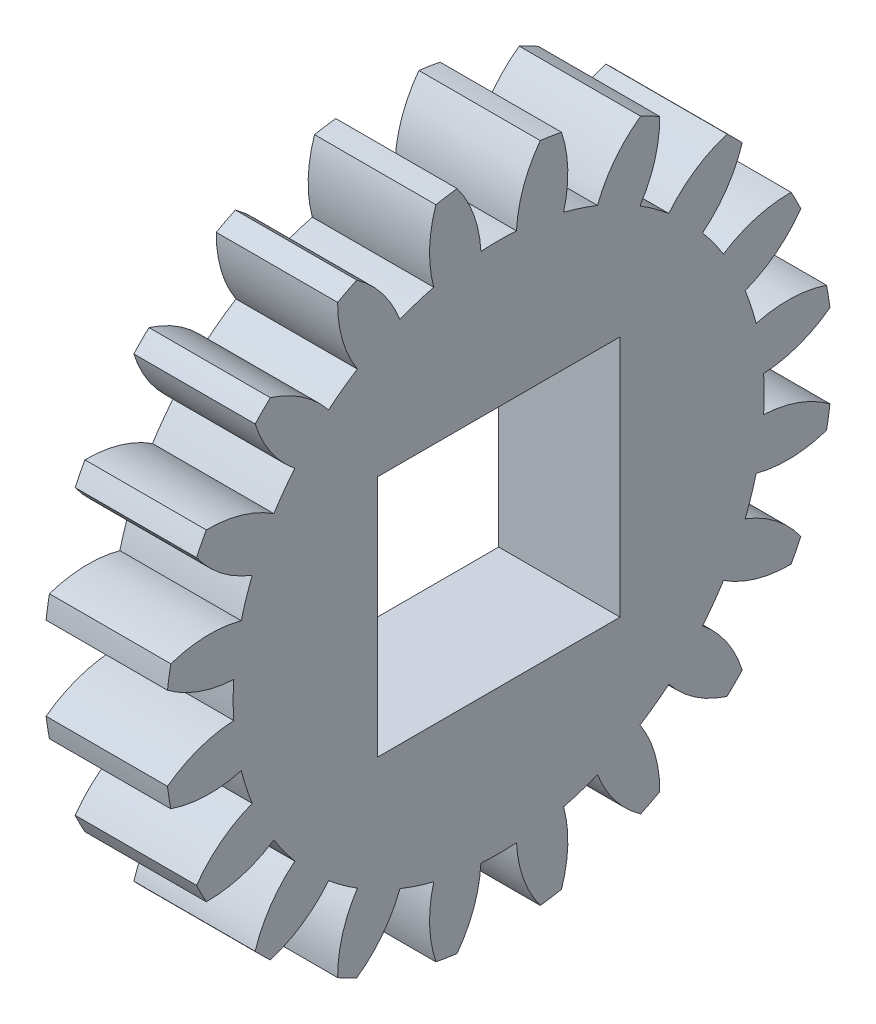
ISO-10303-21;
HEADER;
FILE_DESCRIPTION(('STEP AP214'),'2;1');
FILE_NAME('part.step','',(''),(''),'','','');
FILE_SCHEMA(('AUTOMOTIVE_DESIGN { 1 0 10303 214 1 1 1 1 }'));
ENDSEC;
DATA;
#1=APPLICATION_CONTEXT('core data for automotive mechanical design processes');
#2=APPLICATION_PROTOCOL_DEFINITION('international standard','automotive_design',2000,#1);
#3=PRODUCT_CONTEXT('',#1,'mechanical');
#4=PRODUCT('Part','Part','',(#3));
#5=PRODUCT_RELATED_PRODUCT_CATEGORY('part','',(#4));
#6=PRODUCT_DEFINITION_FORMATION('','',#4);
#7=PRODUCT_DEFINITION_CONTEXT('part definition',#1,'design');
#8=PRODUCT_DEFINITION('design','',#6,#7);
#9=PRODUCT_DEFINITION_SHAPE('','',#8);
#10=(LENGTH_UNIT() NAMED_UNIT(*) SI_UNIT(.MILLI.,.METRE.));
#11=(NAMED_UNIT(*) PLANE_ANGLE_UNIT() SI_UNIT($,.RADIAN.));
#12=(NAMED_UNIT(*) SI_UNIT($,.STERADIAN.) SOLID_ANGLE_UNIT());
#13=UNCERTAINTY_MEASURE_WITH_UNIT(LENGTH_MEASURE(1.E-05),#10,'distance_accuracy_value','');
#14=(GEOMETRIC_REPRESENTATION_CONTEXT(3) GLOBAL_UNCERTAINTY_ASSIGNED_CONTEXT((#13)) GLOBAL_UNIT_ASSIGNED_CONTEXT((#10,
#11,#12)) REPRESENTATION_CONTEXT('',''));
#15=CARTESIAN_POINT('',(0.,0.,0.));
#16=DIRECTION('',(0.,0.,1.));
#17=DIRECTION('',(1.,0.,0.));
#18=AXIS2_PLACEMENT_3D('',#15,#16,#17);
#19=CARTESIAN_POINT('',(4.7625,0.,0.));
#20=DIRECTION('',(-1.,0.,0.));
#21=DIRECTION('',(0.,0.,1.));
#22=AXIS2_PLACEMENT_3D('',#19,#20,#21);
#23=PLANE('',#22);
#24=CARTESIAN_POINT('',(4.7625,5.3148092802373,-5.55040399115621));
#25=DIRECTION('',(-1.,0.,0.));
#26=DIRECTION('',(0.,-0.309016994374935,-0.951056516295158));
#27=AXIS2_PLACEMENT_3D('',#24,#25,#26);
#28=CIRCLE('',#27,3.175);
#29=CARTESIAN_POINT('',(4.7625,6.44612532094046,-2.58379835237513));
#30=VERTEX_POINT('',#29);
#31=CARTESIAN_POINT('',(4.7625,7.903104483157,-3.71155844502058));
#32=VERTEX_POINT('',#31);
#33=EDGE_CURVE('E590',#30,#32,#28,.T.);
#34=ORIENTED_EDGE('',*,*,#33,.F.);
#35=CARTESIAN_POINT('',(4.7625,0.,0.));
#36=DIRECTION('',(-1.,0.,0.));
#37=DIRECTION('',(0.,-0.309016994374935,-0.951056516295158));
#38=AXIS2_PLACEMENT_3D('',#35,#36,#37);
#39=CIRCLE('',#38,6.9446775);
#40=CARTESIAN_POINT('',(4.7625,6.73374349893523,-1.69860062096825));
#41=VERTEX_POINT('',#40);
#42=EDGE_CURVE('E595',#41,#30,#39,.T.);
#43=ORIENTED_EDGE('',*,*,#42,.F.);
#44=CARTESIAN_POINT('',(4.7625,7.56221663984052,1.36640464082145));
#45=DIRECTION('',(-1.,0.,0.));
#46=DIRECTION('',(0.,-0.309016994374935,-0.951056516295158));
#47=AXIS2_PLACEMENT_3D('',#44,#45,#46);
#48=CIRCLE('',#47,3.175);
#49=CARTESIAN_POINT('',(4.7625,8.57534515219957,-1.64261440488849));
#50=VERTEX_POINT('',#49);
#51=EDGE_CURVE('E592',#50,#41,#48,.T.);
#52=ORIENTED_EDGE('',*,*,#51,.F.);
#53=CARTESIAN_POINT('',(4.7625,0.,0.));
#54=DIRECTION('',(-1.,0.,0.));
#55=DIRECTION('',(0.,0.,1.));
#56=AXIS2_PLACEMENT_3D('',#53,#54,#55);
#57=CIRCLE('',#56,8.73125);
#58=CARTESIAN_POINT('',(4.7625,8.66323365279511,-1.08770825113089));
#59=VERTEX_POINT('',#58);
#60=EDGE_CURVE('E1034',#59,#50,#57,.T.);
#61=ORIENTED_EDGE('',*,*,#60,.F.);
#62=CARTESIAN_POINT('',(4.7625,6.7698531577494,-3.63638149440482));
#63=DIRECTION('',(-1.,0.,0.));
#64=DIRECTION('',(0.,0.,-1.));
#65=AXIS2_PLACEMENT_3D('',#62,#63,#64);
#66=CIRCLE('',#65,3.175);
#67=CARTESIAN_POINT('',(4.7625,6.92906709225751,-0.465375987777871));
#68=VERTEX_POINT('',#67);
#69=EDGE_CURVE('E1007',#68,#59,#66,.T.);
#70=ORIENTED_EDGE('',*,*,#69,.F.);
#71=CARTESIAN_POINT('',(4.7625,0.,0.));
#72=DIRECTION('',(-1.,0.,0.));
#73=DIRECTION('',(0.,0.,-1.));
#74=AXIS2_PLACEMENT_3D('',#71,#72,#73);
#75=CIRCLE('',#74,6.9446775);
#76=CARTESIAN_POINT('',(4.7625,6.92906709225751,0.465375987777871));
#77=VERTEX_POINT('',#76);
#78=EDGE_CURVE('E1012',#77,#68,#75,.T.);
#79=ORIENTED_EDGE('',*,*,#78,.F.);
#80=CARTESIAN_POINT('',(4.7625,6.7698531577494,3.63638149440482));
#81=DIRECTION('',(-1.,0.,0.));
#82=DIRECTION('',(0.,0.,-1.));
#83=AXIS2_PLACEMENT_3D('',#80,#81,#82);
#84=CIRCLE('',#83,3.175);
#85=CARTESIAN_POINT('',(4.7625,8.66323365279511,1.08770825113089));
#86=VERTEX_POINT('',#85);
#87=EDGE_CURVE('E1009',#86,#77,#84,.T.);
#88=ORIENTED_EDGE('',*,*,#87,.F.);
#89=CARTESIAN_POINT('',(4.7625,8.57534515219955,1.64261440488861));
#90=VERTEX_POINT('',#89);
#91=EDGE_CURVE('E1032',#90,#86,#57,.T.);
#92=ORIENTED_EDGE('',*,*,#91,.F.);
#93=CARTESIAN_POINT('',(4.7625,7.56221663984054,-1.36640464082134));
#94=DIRECTION('',(-1.,0.,0.));
#95=DIRECTION('',(0.,0.309016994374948,-0.951056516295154));
#96=AXIS2_PLACEMENT_3D('',#93,#94,#95);
#97=CIRCLE('',#96,3.175);
#98=CARTESIAN_POINT('',(4.7625,6.7337434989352,1.69860062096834));
#99=VERTEX_POINT('',#98);
#100=EDGE_CURVE('E985',#99,#90,#97,.T.);
#101=ORIENTED_EDGE('',*,*,#100,.F.);
#102=CARTESIAN_POINT('',(4.7625,0.,0.));
#103=DIRECTION('',(-1.,0.,0.));
#104=DIRECTION('',(0.,0.309016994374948,-0.951056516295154));
#105=AXIS2_PLACEMENT_3D('',#102,#103,#104);
#106=CIRCLE('',#105,6.9446775);
#107=CARTESIAN_POINT('',(4.7625,6.44612532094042,2.58379835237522));
#108=VERTEX_POINT('',#107);
#109=EDGE_CURVE('E990',#108,#99,#106,.T.);
#110=ORIENTED_EDGE('',*,*,#109,.F.);
#111=CARTESIAN_POINT('',(4.7625,5.31480928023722,5.55040399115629));
#112=DIRECTION('',(-1.,0.,0.));
#113=DIRECTION('',(0.,0.309016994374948,-0.951056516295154));
#114=AXIS2_PLACEMENT_3D('',#111,#112,#113);
#115=CIRCLE('',#114,3.175);
#116=CARTESIAN_POINT('',(4.7625,7.90310448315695,3.71155844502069));
#117=VERTEX_POINT('',#116);
#118=EDGE_CURVE('E987',#117,#108,#115,.T.);
#119=ORIENTED_EDGE('',*,*,#118,.F.);
#120=CARTESIAN_POINT('',(4.7625,7.64804212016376,4.21214651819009));
#121=VERTEX_POINT('',#120);
#122=EDGE_CURVE('E1183',#121,#117,#57,.T.);
#123=ORIENTED_EDGE('',*,*,#122,.F.);
#124=CARTESIAN_POINT('',(4.7625,7.61433766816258,1.03732541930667));
#125=DIRECTION('',(-1.,0.,0.));
#126=DIRECTION('',(0.,0.587785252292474,-0.809016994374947));
#127=AXIS2_PLACEMENT_3D('',#124,#125,#126);
#128=CIRCLE('',#127,3.175);
#129=CARTESIAN_POINT('',(4.7625,5.8792741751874,3.69630636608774));
#130=VERTEX_POINT('',#129);
#131=EDGE_CURVE('E963',#130,#121,#128,.T.);
#132=ORIENTED_EDGE('',*,*,#131,.F.);
#133=CARTESIAN_POINT('',(4.7625,0.,0.));
#134=DIRECTION('',(-1.,0.,0.));
#135=DIRECTION('',(0.,0.587785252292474,-0.809016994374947));
#136=AXIS2_PLACEMENT_3D('',#133,#134,#135);
#137=CIRCLE('',#136,6.9446775);
#138=CARTESIAN_POINT('',(4.7625,5.33219189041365,4.44930053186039));
#139=VERTEX_POINT('',#138);
#140=EDGE_CURVE('E968',#139,#130,#137,.T.);
#141=ORIENTED_EDGE('',*,*,#140,.F.);
#142=CARTESIAN_POINT('',(4.7625,3.33951483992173,6.9211142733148));
#143=DIRECTION('',(-1.,0.,0.));
#144=DIRECTION('',(0.,0.587785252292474,-0.809016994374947));
#145=AXIS2_PLACEMENT_3D('',#142,#143,#144);
#146=CIRCLE('',#145,3.175);
#147=CARTESIAN_POINT('',(4.7625,6.36936438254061,5.97209543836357));
#148=VERTEX_POINT('',#147);
#149=EDGE_CURVE('E965',#148,#139,#146,.T.);
#150=ORIENTED_EDGE('',*,*,#149,.F.);
#151=CARTESIAN_POINT('',(4.7625,5.97209543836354,6.36936438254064));
#152=VERTEX_POINT('',#151);
#153=EDGE_CURVE('E1178',#152,#148,#57,.T.);
#154=ORIENTED_EDGE('',*,*,#153,.F.);
#155=CARTESIAN_POINT('',(4.7625,6.92111427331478,3.33951483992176));
#156=DIRECTION('',(-1.,0.,0.));
#157=DIRECTION('',(0.,0.809016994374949,-0.587785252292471));
#158=AXIS2_PLACEMENT_3D('',#155,#156,#157);
#159=CIRCLE('',#158,3.175);
#160=CARTESIAN_POINT('',(4.7625,4.44930053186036,5.33219189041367));
#161=VERTEX_POINT('',#160);
#162=EDGE_CURVE('E941',#161,#152,#159,.T.);
#163=ORIENTED_EDGE('',*,*,#162,.F.);
#164=CARTESIAN_POINT('',(4.7625,0.,0.));
#165=DIRECTION('',(-1.,0.,0.));
#166=DIRECTION('',(0.,0.809016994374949,-0.587785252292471));
#167=AXIS2_PLACEMENT_3D('',#164,#165,#166);
#168=CIRCLE('',#167,6.9446775);
#169=CARTESIAN_POINT('',(4.7625,3.69630636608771,5.87927417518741));
#170=VERTEX_POINT('',#169);
#171=EDGE_CURVE('E946',#170,#161,#168,.T.);
#172=ORIENTED_EDGE('',*,*,#171,.F.);
#173=CARTESIAN_POINT('',(4.7625,1.03732541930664,7.61433766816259));
#174=DIRECTION('',(-1.,0.,0.));
#175=DIRECTION('',(0.,0.809016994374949,-0.587785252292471));
#176=AXIS2_PLACEMENT_3D('',#173,#174,#175);
#177=CIRCLE('',#176,3.175);
#178=CARTESIAN_POINT('',(4.7625,4.21214651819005,7.64804212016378));
#179=VERTEX_POINT('',#178);
#180=EDGE_CURVE('E943',#179,#170,#177,.T.);
#181=ORIENTED_EDGE('',*,*,#180,.F.);
#182=CARTESIAN_POINT('',(4.7625,3.71155844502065,7.90310448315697));
#183=VERTEX_POINT('',#182);
#184=EDGE_CURVE('E1173',#183,#179,#57,.T.);
#185=ORIENTED_EDGE('',*,*,#184,.F.);
#186=CARTESIAN_POINT('',(4.7625,5.55040399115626,5.31480928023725));
#187=DIRECTION('',(-1.,0.,0.));
#188=DIRECTION('',(0.,0.951056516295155,-0.309016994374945));
#189=AXIS2_PLACEMENT_3D('',#186,#187,#188);
#190=CIRCLE('',#189,3.175);
#191=CARTESIAN_POINT('',(4.7625,2.58379835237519,6.44612532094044));
#192=VERTEX_POINT('',#191);
#193=EDGE_CURVE('E919',#192,#183,#190,.T.);
#194=ORIENTED_EDGE('',*,*,#193,.F.);
#195=CARTESIAN_POINT('',(4.7625,0.,0.));
#196=DIRECTION('',(-1.,0.,0.));
#197=DIRECTION('',(0.,0.951056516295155,-0.309016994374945));
#198=AXIS2_PLACEMENT_3D('',#195,#196,#197);
#199=CIRCLE('',#198,6.9446775);
#200=CARTESIAN_POINT('',(4.7625,1.69860062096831,6.73374349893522));
#201=VERTEX_POINT('',#200);
#202=EDGE_CURVE('E924',#201,#192,#199,.T.);
#203=ORIENTED_EDGE('',*,*,#202,.F.);
#204=CARTESIAN_POINT('',(4.7625,-1.36640464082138,7.56221663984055));
#205=DIRECTION('',(-1.,0.,0.));
#206=DIRECTION('',(0.,0.951056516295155,-0.309016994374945));
#207=AXIS2_PLACEMENT_3D('',#204,#205,#206);
#208=CIRCLE('',#207,3.175);
#209=CARTESIAN_POINT('',(4.7625,1.64261440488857,8.57534515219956));
#210=VERTEX_POINT('',#209);
#211=EDGE_CURVE('E921',#210,#201,#208,.T.);
#212=ORIENTED_EDGE('',*,*,#211,.F.);
#213=CARTESIAN_POINT('',(4.7625,1.08770825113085,8.66323365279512));
#214=VERTEX_POINT('',#213);
#215=EDGE_CURVE('E1168',#214,#210,#57,.T.);
#216=ORIENTED_EDGE('',*,*,#215,.F.);
#217=CARTESIAN_POINT('',(4.7625,3.63638149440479,6.76985315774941));
#218=DIRECTION('',(-1.,0.,0.));
#219=DIRECTION('',(0.,1.,0.));
#220=AXIS2_PLACEMENT_3D('',#217,#218,#219);
#221=CIRCLE('',#220,3.175);
#222=CARTESIAN_POINT('',(4.7625,0.465375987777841,6.92906709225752));
#223=VERTEX_POINT('',#222);
#224=EDGE_CURVE('E897',#223,#214,#221,.T.);
#225=ORIENTED_EDGE('',*,*,#224,.F.);
#226=CARTESIAN_POINT('',(4.7625,0.,0.));
#227=DIRECTION('',(-1.,0.,0.));
#228=DIRECTION('',(0.,1.,0.));
#229=AXIS2_PLACEMENT_3D('',#226,#227,#228);
#230=CIRCLE('',#229,6.9446775);
#231=CARTESIAN_POINT('',(4.7625,-0.465375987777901,6.92906709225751));
#232=VERTEX_POINT('',#231);
#233=EDGE_CURVE('E902',#232,#223,#230,.T.);
#234=ORIENTED_EDGE('',*,*,#233,.F.);
#235=CARTESIAN_POINT('',(4.7625,-3.63638149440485,6.76985315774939));
#236=DIRECTION('',(-1.,0.,0.));
#237=DIRECTION('',(0.,1.,0.));
#238=AXIS2_PLACEMENT_3D('',#235,#236,#237);
#239=CIRCLE('',#238,3.175);
#240=CARTESIAN_POINT('',(4.7625,-1.08770825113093,8.66323365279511));
#241=VERTEX_POINT('',#240);
#242=EDGE_CURVE('E899',#241,#232,#239,.T.);
#243=ORIENTED_EDGE('',*,*,#242,.F.);
#244=CARTESIAN_POINT('',(4.7625,-1.64261440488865,8.57534515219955));
#245=VERTEX_POINT('',#244);
#246=EDGE_CURVE('E1163',#245,#241,#57,.T.);
#247=ORIENTED_EDGE('',*,*,#246,.F.);
#248=CARTESIAN_POINT('',(4.7625,1.36640464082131,7.56221663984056));
#249=DIRECTION('',(-1.,0.,0.));
#250=DIRECTION('',(0.,0.951056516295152,0.309016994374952));
#251=AXIS2_PLACEMENT_3D('',#248,#249,#250);
#252=CIRCLE('',#251,3.175);
#253=CARTESIAN_POINT('',(4.7625,-1.69860062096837,6.7337434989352));
#254=VERTEX_POINT('',#253);
#255=EDGE_CURVE('E875',#254,#245,#252,.T.);
#256=ORIENTED_EDGE('',*,*,#255,.F.);
#257=CARTESIAN_POINT('',(4.7625,0.,0.));
#258=DIRECTION('',(-1.,0.,0.));
#259=DIRECTION('',(0.,0.951056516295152,0.309016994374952));
#260=AXIS2_PLACEMENT_3D('',#257,#258,#259);
#261=CIRCLE('',#260,6.9446775);
#262=CARTESIAN_POINT('',(4.7625,-2.58379835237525,6.44612532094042));
#263=VERTEX_POINT('',#262);
#264=EDGE_CURVE('E880',#263,#254,#261,.T.);
#265=ORIENTED_EDGE('',*,*,#264,.F.);
#266=CARTESIAN_POINT('',(4.7625,-5.55040399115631,5.31480928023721));
#267=DIRECTION('',(-1.,0.,0.));
#268=DIRECTION('',(0.,0.951056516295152,0.309016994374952));
#269=AXIS2_PLACEMENT_3D('',#266,#267,#268);
#270=CIRCLE('',#269,3.175);
#271=CARTESIAN_POINT('',(4.7625,-3.71155844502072,7.90310448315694));
#272=VERTEX_POINT('',#271);
#273=EDGE_CURVE('E877',#272,#263,#270,.T.);
#274=ORIENTED_EDGE('',*,*,#273,.F.);
#275=CARTESIAN_POINT('',(4.7625,-4.21214651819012,7.64804212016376));
#276=VERTEX_POINT('',#275);
#277=EDGE_CURVE('E1158',#276,#272,#57,.T.);
#278=ORIENTED_EDGE('',*,*,#277,.F.);
#279=CARTESIAN_POINT('',(4.7625,-1.0373254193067,7.61433766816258));
#280=DIRECTION('',(-1.,0.,0.));
#281=DIRECTION('',(0.,0.809016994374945,0.587785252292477));
#282=AXIS2_PLACEMENT_3D('',#279,#280,#281);
#283=CIRCLE('',#282,3.175);
#284=CARTESIAN_POINT('',(4.7625,-3.69630636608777,5.87927417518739));
#285=VERTEX_POINT('',#284);
#286=EDGE_CURVE('E853',#285,#276,#283,.T.);
#287=ORIENTED_EDGE('',*,*,#286,.F.);
#288=CARTESIAN_POINT('',(4.7625,0.,0.));
#289=DIRECTION('',(-1.,0.,0.));
#290=DIRECTION('',(0.,0.809016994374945,0.587785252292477));
#291=AXIS2_PLACEMENT_3D('',#288,#289,#290);
#292=CIRCLE('',#291,6.9446775);
#293=CARTESIAN_POINT('',(4.7625,-4.44930053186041,5.33219189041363));
#294=VERTEX_POINT('',#293);
#295=EDGE_CURVE('E858',#294,#285,#292,.T.);
#296=ORIENTED_EDGE('',*,*,#295,.F.);
#297=CARTESIAN_POINT('',(4.7625,-6.92111427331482,3.33951483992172));
#298=DIRECTION('',(-1.,0.,0.));
#299=DIRECTION('',(0.,0.809016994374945,0.587785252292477));
#300=AXIS2_PLACEMENT_3D('',#297,#298,#299);
#301=CIRCLE('',#300,3.175);
#302=CARTESIAN_POINT('',(4.7625,-5.9720954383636,6.3693643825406));
#303=VERTEX_POINT('',#302);
#304=EDGE_CURVE('E855',#303,#294,#301,.T.);
#305=ORIENTED_EDGE('',*,*,#304,.F.);
#306=CARTESIAN_POINT('',(4.7625,-6.36936438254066,5.97209543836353));
#307=VERTEX_POINT('',#306);
#308=EDGE_CURVE('E1153',#307,#303,#57,.T.);
#309=ORIENTED_EDGE('',*,*,#308,.F.);
#310=CARTESIAN_POINT('',(4.7625,-3.33951483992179,6.92111427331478));
#311=DIRECTION('',(-1.,0.,0.));
#312=DIRECTION('',(0.,0.587785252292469,0.809016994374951));
#313=AXIS2_PLACEMENT_3D('',#310,#311,#312);
#314=CIRCLE('',#313,3.175);
#315=CARTESIAN_POINT('',(4.7625,-5.33219189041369,4.44930053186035));
#316=VERTEX_POINT('',#315);
#317=EDGE_CURVE('E831',#316,#307,#314,.T.);
#318=ORIENTED_EDGE('',*,*,#317,.F.);
#319=CARTESIAN_POINT('',(4.7625,0.,0.));
#320=DIRECTION('',(-1.,0.,0.));
#321=DIRECTION('',(0.,0.587785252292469,0.809016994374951));
#322=AXIS2_PLACEMENT_3D('',#319,#320,#321);
#323=CIRCLE('',#322,6.9446775);
#324=CARTESIAN_POINT('',(4.7625,-5.87927417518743,3.6963063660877));
#325=VERTEX_POINT('',#324);
#326=EDGE_CURVE('E836',#325,#316,#323,.T.);
#327=ORIENTED_EDGE('',*,*,#326,.F.);
#328=CARTESIAN_POINT('',(4.7625,-7.6143376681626,1.03732541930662));
#329=DIRECTION('',(-1.,0.,0.));
#330=DIRECTION('',(0.,0.587785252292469,0.809016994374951));
#331=AXIS2_PLACEMENT_3D('',#328,#329,#330);
#332=CIRCLE('',#331,3.175);
#333=CARTESIAN_POINT('',(4.7625,-7.64804212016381,4.21214651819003));
#334=VERTEX_POINT('',#333);
#335=EDGE_CURVE('E833',#334,#325,#332,.T.);
#336=ORIENTED_EDGE('',*,*,#335,.F.);
#337=CARTESIAN_POINT('',(4.7625,-7.90310448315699,3.71155844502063));
#338=VERTEX_POINT('',#337);
#339=EDGE_CURVE('E1148',#338,#334,#57,.T.);
#340=ORIENTED_EDGE('',*,*,#339,.F.);
#341=CARTESIAN_POINT('',(4.7625,-5.31480928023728,5.55040399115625));
#342=DIRECTION('',(-1.,0.,0.));
#343=DIRECTION('',(0.,0.309016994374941,0.951056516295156));
#344=AXIS2_PLACEMENT_3D('',#341,#342,#343);
#345=CIRCLE('',#344,3.175);
#346=CARTESIAN_POINT('',(4.7625,-6.44612532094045,2.58379835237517));
#347=VERTEX_POINT('',#346);
#348=EDGE_CURVE('E809',#347,#338,#345,.T.);
#349=ORIENTED_EDGE('',*,*,#348,.F.);
#350=CARTESIAN_POINT('',(4.7625,0.,0.));
#351=DIRECTION('',(-1.,0.,0.));
#352=DIRECTION('',(0.,0.309016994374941,0.951056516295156));
#353=AXIS2_PLACEMENT_3D('',#350,#351,#352);
#354=CIRCLE('',#353,6.9446775);
#355=CARTESIAN_POINT('',(4.7625,-6.73374349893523,1.69860062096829));
#356=VERTEX_POINT('',#355);
#357=EDGE_CURVE('E814',#356,#347,#354,.T.);
#358=ORIENTED_EDGE('',*,*,#357,.F.);
#359=CARTESIAN_POINT('',(4.7625,-7.56221663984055,-1.3664046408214));
#360=DIRECTION('',(-1.,0.,0.));
#361=DIRECTION('',(0.,0.309016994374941,0.951056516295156));
#362=AXIS2_PLACEMENT_3D('',#359,#360,#361);
#363=CIRCLE('',#362,3.175);
#364=CARTESIAN_POINT('',(4.7625,-8.57534515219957,1.64261440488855));
#365=VERTEX_POINT('',#364);
#366=EDGE_CURVE('E811',#365,#356,#363,.T.);
#367=ORIENTED_EDGE('',*,*,#366,.F.);
#368=CARTESIAN_POINT('',(4.7625,-8.66323365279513,1.08770825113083));
#369=VERTEX_POINT('',#368);
#370=EDGE_CURVE('E1143',#369,#365,#57,.T.);
#371=ORIENTED_EDGE('',*,*,#370,.F.);
#372=CARTESIAN_POINT('',(4.7625,-6.76985315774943,3.63638149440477));
#373=DIRECTION('',(-1.,0.,0.));
#374=DIRECTION('',(0.,0.,1.));
#375=AXIS2_PLACEMENT_3D('',#372,#373,#374);
#376=CIRCLE('',#375,3.175);
#377=CARTESIAN_POINT('',(4.7625,-6.92906709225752,0.465375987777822));
#378=VERTEX_POINT('',#377);
#379=EDGE_CURVE('E787',#378,#369,#376,.T.);
#380=ORIENTED_EDGE('',*,*,#379,.F.);
#381=CARTESIAN_POINT('',(4.7625,0.,0.));
#382=DIRECTION('',(-1.,0.,0.));
#383=DIRECTION('',(0.,0.,1.));
#384=AXIS2_PLACEMENT_3D('',#381,#382,#383);
#385=CIRCLE('',#384,6.9446775);
#386=CARTESIAN_POINT('',(4.7625,-6.92906709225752,-0.46537598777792));
#387=VERTEX_POINT('',#386);
#388=EDGE_CURVE('E792',#387,#378,#385,.T.);
#389=ORIENTED_EDGE('',*,*,#388,.F.);
#390=CARTESIAN_POINT('',(4.7625,-6.76985315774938,-3.63638149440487));
#391=DIRECTION('',(-1.,0.,0.));
#392=DIRECTION('',(0.,0.,1.));
#393=AXIS2_PLACEMENT_3D('',#390,#391,#392);
#394=CIRCLE('',#393,3.175);
#395=CARTESIAN_POINT('',(4.7625,-8.66323365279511,-1.08770825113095));
#396=VERTEX_POINT('',#395);
#397=EDGE_CURVE('E789',#396,#387,#394,.T.);
#398=ORIENTED_EDGE('',*,*,#397,.F.);
#399=CARTESIAN_POINT('',(4.7625,-8.57534515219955,-1.64261440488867));
#400=VERTEX_POINT('',#399);
#401=EDGE_CURVE('E1138',#400,#396,#57,.T.);
#402=ORIENTED_EDGE('',*,*,#401,.F.);
#403=CARTESIAN_POINT('',(4.7625,-7.56221663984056,1.36640464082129));
#404=DIRECTION('',(-1.,0.,0.));
#405=DIRECTION('',(0.,-0.309016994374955,0.951056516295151));
#406=AXIS2_PLACEMENT_3D('',#403,#404,#405);
#407=CIRCLE('',#406,3.175);
#408=CARTESIAN_POINT('',(4.7625,-6.7337434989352,-1.69860062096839));
#409=VERTEX_POINT('',#408);
#410=EDGE_CURVE('E765',#409,#400,#407,.T.);
#411=ORIENTED_EDGE('',*,*,#410,.F.);
#412=CARTESIAN_POINT('',(4.7625,0.,0.));
#413=DIRECTION('',(-1.,0.,0.));
#414=DIRECTION('',(0.,-0.309016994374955,0.951056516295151));
#415=AXIS2_PLACEMENT_3D('',#412,#413,#414);
#416=CIRCLE('',#415,6.9446775);
#417=CARTESIAN_POINT('',(4.7625,-6.44612532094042,-2.58379835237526));
#418=VERTEX_POINT('',#417);
#419=EDGE_CURVE('E770',#418,#409,#416,.T.);
#420=ORIENTED_EDGE('',*,*,#419,.F.);
#421=CARTESIAN_POINT('',(4.7625,-5.3148092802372,-5.55040399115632));
#422=DIRECTION('',(-1.,0.,0.));
#423=DIRECTION('',(0.,-0.309016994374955,0.951056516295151));
#424=AXIS2_PLACEMENT_3D('',#421,#422,#423);
#425=CIRCLE('',#424,3.175);
#426=CARTESIAN_POINT('',(4.7625,-7.90310448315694,-3.71155844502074));
#427=VERTEX_POINT('',#426);
#428=EDGE_CURVE('E767',#427,#418,#425,.T.);
#429=ORIENTED_EDGE('',*,*,#428,.F.);
#430=CARTESIAN_POINT('',(4.7625,-7.64804212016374,-4.21214651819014));
#431=VERTEX_POINT('',#430);
#432=EDGE_CURVE('E1133',#431,#427,#57,.T.);
#433=ORIENTED_EDGE('',*,*,#432,.F.);
#434=CARTESIAN_POINT('',(4.7625,-7.61433766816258,-1.03732541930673));
#435=DIRECTION('',(-1.,0.,0.));
#436=DIRECTION('',(0.,-0.58778525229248,0.809016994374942));
#437=AXIS2_PLACEMENT_3D('',#434,#435,#436);
#438=CIRCLE('',#437,3.175);
#439=CARTESIAN_POINT('',(4.7625,-5.87927417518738,-3.69630636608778));
#440=VERTEX_POINT('',#439);
#441=EDGE_CURVE('E743',#440,#431,#438,.T.);
#442=ORIENTED_EDGE('',*,*,#441,.F.);
#443=CARTESIAN_POINT('',(4.7625,0.,0.));
#444=DIRECTION('',(-1.,0.,0.));
#445=DIRECTION('',(0.,-0.58778525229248,0.809016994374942));
#446=AXIS2_PLACEMENT_3D('',#443,#444,#445);
#447=CIRCLE('',#446,6.9446775);
#448=CARTESIAN_POINT('',(4.7625,-5.33219189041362,-4.44930053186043));
#449=VERTEX_POINT('',#448);
#450=EDGE_CURVE('E748',#449,#440,#447,.T.);
#451=ORIENTED_EDGE('',*,*,#450,.F.);
#452=CARTESIAN_POINT('',(4.7625,-3.33951483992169,-6.92111427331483));
#453=DIRECTION('',(-1.,0.,0.));
#454=DIRECTION('',(0.,-0.58778525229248,0.809016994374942));
#455=AXIS2_PLACEMENT_3D('',#452,#453,#454);
#456=CIRCLE('',#455,3.175);
#457=CARTESIAN_POINT('',(4.7625,-6.36936438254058,-5.97209543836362));
#458=VERTEX_POINT('',#457);
#459=EDGE_CURVE('E745',#458,#449,#456,.T.);
#460=ORIENTED_EDGE('',*,*,#459,.F.);
#461=CARTESIAN_POINT('',(4.7625,-5.97209543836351,-6.36936438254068));
#462=VERTEX_POINT('',#461);
#463=EDGE_CURVE('E1128',#462,#458,#57,.T.);
#464=ORIENTED_EDGE('',*,*,#463,.F.);
#465=CARTESIAN_POINT('',(4.7625,-6.92111427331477,-3.33951483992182));
#466=DIRECTION('',(-1.,0.,0.));
#467=DIRECTION('',(0.,-0.809016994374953,0.587785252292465));
#468=AXIS2_PLACEMENT_3D('',#465,#466,#467);
#469=CIRCLE('',#468,3.175);
#470=CARTESIAN_POINT('',(4.7625,-4.44930053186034,-5.3321918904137));
#471=VERTEX_POINT('',#470);
#472=EDGE_CURVE('E721',#471,#462,#469,.T.);
#473=ORIENTED_EDGE('',*,*,#472,.F.);
#474=CARTESIAN_POINT('',(4.7625,0.,0.));
#475=DIRECTION('',(-1.,0.,0.));
#476=DIRECTION('',(0.,-0.809016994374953,0.587785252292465));
#477=AXIS2_PLACEMENT_3D('',#474,#475,#476);
#478=CIRCLE('',#477,6.9446775);
#479=CARTESIAN_POINT('',(4.7625,-3.69630636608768,-5.87927417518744));
#480=VERTEX_POINT('',#479);
#481=EDGE_CURVE('E726',#480,#471,#478,.T.);
#482=ORIENTED_EDGE('',*,*,#481,.F.);
#483=CARTESIAN_POINT('',(4.7625,-1.03732541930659,-7.6143376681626));
#484=DIRECTION('',(-1.,0.,0.));
#485=DIRECTION('',(0.,-0.809016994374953,0.587785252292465));
#486=AXIS2_PLACEMENT_3D('',#483,#484,#485);
#487=CIRCLE('',#486,3.175);
#488=CARTESIAN_POINT('',(4.7625,-4.21214651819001,-7.64804212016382));
#489=VERTEX_POINT('',#488);
#490=EDGE_CURVE('E723',#489,#480,#487,.T.);
#491=ORIENTED_EDGE('',*,*,#490,.F.);
#492=CARTESIAN_POINT('',(4.7625,-3.71155844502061,-7.903104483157));
#493=VERTEX_POINT('',#492);
#494=EDGE_CURVE('E1123',#493,#489,#57,.T.);
#495=ORIENTED_EDGE('',*,*,#494,.F.);
#496=CARTESIAN_POINT('',(4.7625,-5.55040399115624,-5.31480928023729));
#497=DIRECTION('',(-1.,0.,0.));
#498=DIRECTION('',(0.,-0.951056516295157,0.309016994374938));
#499=AXIS2_PLACEMENT_3D('',#496,#497,#498);
#500=CIRCLE('',#499,3.175);
#501=CARTESIAN_POINT('',(4.7625,-2.58379835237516,-6.44612532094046));
#502=VERTEX_POINT('',#501);
#503=EDGE_CURVE('E699',#502,#493,#500,.T.);
#504=ORIENTED_EDGE('',*,*,#503,.F.);
#505=CARTESIAN_POINT('',(4.7625,0.,0.));
#506=DIRECTION('',(-1.,0.,0.));
#507=DIRECTION('',(0.,-0.951056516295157,0.309016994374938));
#508=AXIS2_PLACEMENT_3D('',#505,#506,#507);
#509=CIRCLE('',#508,6.9446775);
#510=CARTESIAN_POINT('',(4.7625,-1.69860062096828,-6.73374349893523));
#511=VERTEX_POINT('',#510);
#512=EDGE_CURVE('E704',#511,#502,#509,.T.);
#513=ORIENTED_EDGE('',*,*,#512,.F.);
#514=CARTESIAN_POINT('',(4.7625,1.36640464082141,-7.56221663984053));
#515=DIRECTION('',(-1.,0.,0.));
#516=DIRECTION('',(0.,-0.951056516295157,0.309016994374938));
#517=AXIS2_PLACEMENT_3D('',#514,#515,#516);
#518=CIRCLE('',#517,3.175);
#519=CARTESIAN_POINT('',(4.7625,-1.64261440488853,-8.57534515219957));
#520=VERTEX_POINT('',#519);
#521=EDGE_CURVE('E701',#520,#511,#518,.T.);
#522=ORIENTED_EDGE('',*,*,#521,.F.);
#523=CARTESIAN_POINT('',(4.7625,-1.08770825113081,-8.66323365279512));
#524=VERTEX_POINT('',#523);
#525=EDGE_CURVE('E1118',#524,#520,#57,.T.);
#526=ORIENTED_EDGE('',*,*,#525,.F.);
#527=CARTESIAN_POINT('',(4.7625,-3.63638149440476,-6.76985315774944));
#528=DIRECTION('',(-1.,0.,0.));
#529=DIRECTION('',(0.,-1.,0.));
#530=AXIS2_PLACEMENT_3D('',#527,#528,#529);
#531=CIRCLE('',#530,3.175);
#532=CARTESIAN_POINT('',(4.7625,-0.465375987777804,-6.92906709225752));
#533=VERTEX_POINT('',#532);
#534=EDGE_CURVE('E677',#533,#524,#531,.T.);
#535=ORIENTED_EDGE('',*,*,#534,.F.);
#536=CARTESIAN_POINT('',(4.7625,0.,0.));
#537=DIRECTION('',(-1.,0.,0.));
#538=DIRECTION('',(0.,-1.,0.));
#539=AXIS2_PLACEMENT_3D('',#536,#537,#538);
#540=CIRCLE('',#539,6.9446775);
#541=CARTESIAN_POINT('',(4.7625,0.465375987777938,-6.92906709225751));
#542=VERTEX_POINT('',#541);
#543=EDGE_CURVE('E682',#542,#533,#540,.T.);
#544=ORIENTED_EDGE('',*,*,#543,.F.);
#545=CARTESIAN_POINT('',(4.7625,3.63638149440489,-6.76985315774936));
#546=DIRECTION('',(-1.,0.,0.));
#547=DIRECTION('',(0.,-1.,0.));
#548=AXIS2_PLACEMENT_3D('',#545,#546,#547);
#549=CIRCLE('',#548,3.175);
#550=CARTESIAN_POINT('',(4.7625,1.08770825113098,-8.6632336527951));
#551=VERTEX_POINT('',#550);
#552=EDGE_CURVE('E679',#551,#542,#549,.T.);
#553=ORIENTED_EDGE('',*,*,#552,.F.);
#554=CARTESIAN_POINT('',(4.7625,1.64261440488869,-8.57534515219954));
#555=VERTEX_POINT('',#554);
#556=EDGE_CURVE('E1113',#555,#551,#57,.T.);
#557=ORIENTED_EDGE('',*,*,#556,.F.);
#558=CARTESIAN_POINT('',(4.7625,-1.36640464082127,-7.56221663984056));
#559=DIRECTION('',(-1.,0.,0.));
#560=DIRECTION('',(0.,-0.95105651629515,-0.309016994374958));
#561=AXIS2_PLACEMENT_3D('',#558,#559,#560);
#562=CIRCLE('',#561,3.175);
#563=CARTESIAN_POINT('',(4.7625,1.69860062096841,-6.73374349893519));
#564=VERTEX_POINT('',#563);
#565=EDGE_CURVE('E655',#564,#555,#562,.T.);
#566=ORIENTED_EDGE('',*,*,#565,.F.);
#567=CARTESIAN_POINT('',(4.7625,0.,0.));
#568=DIRECTION('',(-1.,0.,0.));
#569=DIRECTION('',(0.,-0.95105651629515,-0.309016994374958));
#570=AXIS2_PLACEMENT_3D('',#567,#568,#569);
#571=CIRCLE('',#570,6.9446775);
#572=CARTESIAN_POINT('',(4.7625,2.58379835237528,-6.4461253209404));
#573=VERTEX_POINT('',#572);
#574=EDGE_CURVE('E660',#573,#564,#571,.T.);
#575=ORIENTED_EDGE('',*,*,#574,.F.);
#576=CARTESIAN_POINT('',(4.7625,5.55040399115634,-5.31480928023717));
#577=DIRECTION('',(-1.,0.,0.));
#578=DIRECTION('',(0.,-0.95105651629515,-0.309016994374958));
#579=AXIS2_PLACEMENT_3D('',#576,#577,#578);
#580=CIRCLE('',#579,3.175);
#581=CARTESIAN_POINT('',(4.7625,3.71155844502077,-7.90310448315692));
#582=VERTEX_POINT('',#581);
#583=EDGE_CURVE('E657',#582,#573,#580,.T.);
#584=ORIENTED_EDGE('',*,*,#583,.F.);
#585=CARTESIAN_POINT('',(4.7625,4.21214651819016,-7.64804212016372));
#586=VERTEX_POINT('',#585);
#587=EDGE_CURVE('E1108',#586,#582,#57,.T.);
#588=ORIENTED_EDGE('',*,*,#587,.F.);
#589=CARTESIAN_POINT('',(4.7625,1.03732541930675,-7.61433766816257));
#590=DIRECTION('',(-1.,0.,0.));
#591=DIRECTION('',(0.,-0.80901699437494,-0.587785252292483));
#592=AXIS2_PLACEMENT_3D('',#589,#590,#591);
#593=CIRCLE('',#592,3.175);
#594=CARTESIAN_POINT('',(4.7625,3.6963063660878,-5.87927417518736));
#595=VERTEX_POINT('',#594);
#596=EDGE_CURVE('E633',#595,#586,#593,.T.);
#597=ORIENTED_EDGE('',*,*,#596,.F.);
#598=CARTESIAN_POINT('',(4.7625,0.,0.));
#599=DIRECTION('',(-1.,0.,0.));
#600=DIRECTION('',(0.,-0.80901699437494,-0.587785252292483));
#601=AXIS2_PLACEMENT_3D('',#598,#599,#600);
#602=CIRCLE('',#601,6.9446775);
#603=CARTESIAN_POINT('',(4.7625,4.44930053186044,-5.3321918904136));
#604=VERTEX_POINT('',#603);
#605=EDGE_CURVE('E638',#604,#595,#602,.T.);
#606=ORIENTED_EDGE('',*,*,#605,.F.);
#607=CARTESIAN_POINT('',(4.7625,6.92111427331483,-3.33951483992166));
#608=DIRECTION('',(-1.,0.,0.));
#609=DIRECTION('',(0.,-0.80901699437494,-0.587785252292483));
#610=AXIS2_PLACEMENT_3D('',#607,#608,#609);
#611=CIRCLE('',#610,3.175);
#612=CARTESIAN_POINT('',(4.7625,5.97209543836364,-6.36936438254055));
#613=VERTEX_POINT('',#612);
#614=EDGE_CURVE('E635',#613,#604,#611,.T.);
#615=ORIENTED_EDGE('',*,*,#614,.F.);
#616=CARTESIAN_POINT('',(4.7625,6.3693643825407,-5.97209543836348));
#617=VERTEX_POINT('',#616);
#618=EDGE_CURVE('E1107',#617,#613,#57,.T.);
#619=ORIENTED_EDGE('',*,*,#618,.F.);
#620=CARTESIAN_POINT('',(4.7625,3.33951483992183,-6.92111427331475));
#621=DIRECTION('',(-1.,0.,0.));
#622=DIRECTION('',(0.,-0.587785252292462,-0.809016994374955));
#623=AXIS2_PLACEMENT_3D('',#620,#621,#622);
#624=CIRCLE('',#623,3.175);
#625=CARTESIAN_POINT('',(4.7625,5.33219189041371,-4.44930053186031));
#626=VERTEX_POINT('',#625);
#627=EDGE_CURVE('E611',#626,#617,#624,.T.);
#628=ORIENTED_EDGE('',*,*,#627,.F.);
#629=CARTESIAN_POINT('',(4.7625,0.,0.));
#630=DIRECTION('',(-1.,0.,0.));
#631=DIRECTION('',(0.,-0.587785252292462,-0.809016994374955));
#632=AXIS2_PLACEMENT_3D('',#629,#630,#631);
#633=CIRCLE('',#632,6.9446775);
#634=CARTESIAN_POINT('',(4.7625,5.87927417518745,-3.69630636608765));
#635=VERTEX_POINT('',#634);
#636=EDGE_CURVE('E616',#635,#626,#633,.T.);
#637=ORIENTED_EDGE('',*,*,#636,.F.);
#638=CARTESIAN_POINT('',(4.7625,7.61433766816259,-1.03732541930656));
#639=DIRECTION('',(-1.,0.,0.));
#640=DIRECTION('',(0.,-0.587785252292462,-0.809016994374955));
#641=AXIS2_PLACEMENT_3D('',#638,#639,#640);
#642=CIRCLE('',#641,3.175);
#643=CARTESIAN_POINT('',(4.7625,7.64804212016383,-4.21214651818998));
#644=VERTEX_POINT('',#643);
#645=EDGE_CURVE('E613',#644,#635,#642,.T.);
#646=ORIENTED_EDGE('',*,*,#645,.F.);
#647=EDGE_CURVE('E1038',#32,#644,#57,.T.);
#648=ORIENTED_EDGE('',*,*,#647,.F.);
#649=EDGE_LOOP('',(#34,#43,#52,#61,#70,#79,#88,#92,#101,#110,#119,#123,#132,#141,#150,#154,#163,
#172,#181,#185,#194,#203,#212,#216,#225,#234,#243,#247,#256,#265,#274,#278,#287,#296,#305,#309,
#318,#327,#336,#340,#349,#358,#367,#371,#380,#389,#398,#402,#411,#420,#429,#433,#442,#451,#460,
#464,#473,#482,#491,#495,#504,#513,#522,#526,#535,#544,#553,#557,#566,#575,#584,#588,#597,#606,
#615,#619,#628,#637,#646,#648));
#650=FACE_BOUND('',#649,.T.);
#651=DIRECTION('',(0.,-1.,0.));
#652=VECTOR('',#651,1.);
#653=CARTESIAN_POINT('',(4.7625,0.,3.175));
#654=LINE('',#653,#652);
#655=CARTESIAN_POINT('',(4.7625,3.17499999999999,3.175));
#656=VERTEX_POINT('',#655);
#657=CARTESIAN_POINT('',(4.7625,-3.17500000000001,3.175));
#658=VERTEX_POINT('',#657);
#659=EDGE_CURVE('E557',#656,#658,#654,.T.);
#660=ORIENTED_EDGE('',*,*,#659,.F.);
#661=DIRECTION('',(0.,0.,1.));
#662=VECTOR('',#661,1.);
#663=CARTESIAN_POINT('',(4.7625,3.17499999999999,0.));
#664=LINE('',#663,#662);
#665=CARTESIAN_POINT('',(4.7625,3.17499999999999,-3.175));
#666=VERTEX_POINT('',#665);
#667=EDGE_CURVE('E560',#666,#656,#664,.T.);
#668=ORIENTED_EDGE('',*,*,#667,.F.);
#669=DIRECTION('',(0.,1.,0.));
#670=VECTOR('',#669,1.);
#671=CARTESIAN_POINT('',(4.7625,0.,-3.175));
#672=LINE('',#671,#670);
#673=CARTESIAN_POINT('',(4.7625,-3.17500000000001,-3.175));
#674=VERTEX_POINT('',#673);
#675=EDGE_CURVE('E584',#674,#666,#672,.T.);
#676=ORIENTED_EDGE('',*,*,#675,.F.);
#677=DIRECTION('',(0.,0.,-1.));
#678=VECTOR('',#677,1.);
#679=CARTESIAN_POINT('',(4.7625,-3.17500000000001,0.));
#680=LINE('',#679,#678);
#681=EDGE_CURVE('E586',#658,#674,#680,.T.);
#682=ORIENTED_EDGE('',*,*,#681,.F.);
#683=EDGE_LOOP('',(#660,#668,#676,#682));
#684=FACE_BOUND('',#683,.T.);
#685=ADVANCED_FACE('F35',(#650,#684),#23,.F.);
#686=CARTESIAN_POINT('',(1.5875,0.,0.));
#687=DIRECTION('',(1.,0.,0.));
#688=DIRECTION('',(0.,0.,-1.));
#689=AXIS2_PLACEMENT_3D('',#686,#687,#688);
#690=PLANE('',#689);
#691=CARTESIAN_POINT('',(1.5875,5.3148092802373,-5.55040399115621));
#692=DIRECTION('',(-1.,0.,0.));
#693=DIRECTION('',(0.,-0.309016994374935,-0.951056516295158));
#694=AXIS2_PLACEMENT_3D('',#691,#692,#693);
#695=CIRCLE('',#694,3.175);
#696=CARTESIAN_POINT('',(1.5875,6.44612532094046,-2.58379835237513));
#697=VERTEX_POINT('',#696);
#698=CARTESIAN_POINT('',(1.5875,7.903104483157,-3.71155844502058));
#699=VERTEX_POINT('',#698);
#700=EDGE_CURVE('E589',#697,#699,#695,.T.);
#701=ORIENTED_EDGE('',*,*,#700,.T.);
#702=CARTESIAN_POINT('',(1.5875,0.,0.));
#703=DIRECTION('',(-1.,0.,0.));
#704=DIRECTION('',(0.,0.,1.));
#705=AXIS2_PLACEMENT_3D('',#702,#703,#704);
#706=CIRCLE('',#705,8.73125);
#707=CARTESIAN_POINT('',(1.5875,7.64804212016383,-4.21214651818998));
#708=VERTEX_POINT('',#707);
#709=EDGE_CURVE('E1033',#699,#708,#706,.T.);
#710=ORIENTED_EDGE('',*,*,#709,.T.);
#711=CARTESIAN_POINT('',(1.5875,7.61433766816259,-1.03732541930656));
#712=DIRECTION('',(1.,0.,0.));
#713=DIRECTION('',(0.,0.,-1.));
#714=AXIS2_PLACEMENT_3D('',#711,#712,#713);
#715=CIRCLE('',#714,3.175);
#716=CARTESIAN_POINT('',(1.5875,5.87927417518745,-3.69630636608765));
#717=VERTEX_POINT('',#716);
#718=EDGE_CURVE('E42',#717,#708,#715,.T.);
#719=ORIENTED_EDGE('',*,*,#718,.F.);
#720=CARTESIAN_POINT('',(1.5875,0.,0.));
#721=DIRECTION('',(-1.,0.,0.));
#722=DIRECTION('',(0.,-0.587785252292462,-0.809016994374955));
#723=AXIS2_PLACEMENT_3D('',#720,#721,#722);
#724=CIRCLE('',#723,6.9446775);
#725=CARTESIAN_POINT('',(1.5875,5.33219189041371,-4.44930053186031));
#726=VERTEX_POINT('',#725);
#727=EDGE_CURVE('E614',#717,#726,#724,.T.);
#728=ORIENTED_EDGE('',*,*,#727,.T.);
#729=CARTESIAN_POINT('',(1.5875,3.33951483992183,-6.92111427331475));
#730=DIRECTION('',(-1.,0.,0.));
#731=DIRECTION('',(0.,-0.587785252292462,-0.809016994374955));
#732=AXIS2_PLACEMENT_3D('',#729,#730,#731);
#733=CIRCLE('',#732,3.175);
#734=CARTESIAN_POINT('',(1.5875,6.3693643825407,-5.97209543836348));
#735=VERTEX_POINT('',#734);
#736=EDGE_CURVE('E610',#726,#735,#733,.T.);
#737=ORIENTED_EDGE('',*,*,#736,.T.);
#738=CARTESIAN_POINT('',(1.5875,5.97209543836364,-6.36936438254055));
#739=VERTEX_POINT('',#738);
#740=EDGE_CURVE('E1231',#735,#739,#706,.T.);
#741=ORIENTED_EDGE('',*,*,#740,.T.);
#742=CARTESIAN_POINT('',(1.5875,6.92111427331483,-3.33951483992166));
#743=DIRECTION('',(1.,0.,0.));
#744=DIRECTION('',(0.,0.,-1.));
#745=AXIS2_PLACEMENT_3D('',#742,#743,#744);
#746=CIRCLE('',#745,3.175);
#747=CARTESIAN_POINT('',(1.5875,4.44930053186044,-5.3321918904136));
#748=VERTEX_POINT('',#747);
#749=EDGE_CURVE('E1089',#748,#739,#746,.T.);
#750=ORIENTED_EDGE('',*,*,#749,.F.);
#751=CARTESIAN_POINT('',(1.5875,0.,0.));
#752=DIRECTION('',(-1.,0.,0.));
#753=DIRECTION('',(0.,-0.80901699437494,-0.587785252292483));
#754=AXIS2_PLACEMENT_3D('',#751,#752,#753);
#755=CIRCLE('',#754,6.9446775);
#756=CARTESIAN_POINT('',(1.5875,3.6963063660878,-5.87927417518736));
#757=VERTEX_POINT('',#756);
#758=EDGE_CURVE('E636',#748,#757,#755,.T.);
#759=ORIENTED_EDGE('',*,*,#758,.T.);
#760=CARTESIAN_POINT('',(1.5875,1.03732541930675,-7.61433766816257));
#761=DIRECTION('',(-1.,0.,0.));
#762=DIRECTION('',(0.,-0.80901699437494,-0.587785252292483));
#763=AXIS2_PLACEMENT_3D('',#760,#761,#762);
#764=CIRCLE('',#763,3.175);
#765=CARTESIAN_POINT('',(1.5875,4.21214651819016,-7.64804212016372));
#766=VERTEX_POINT('',#765);
#767=EDGE_CURVE('E632',#757,#766,#764,.T.);
#768=ORIENTED_EDGE('',*,*,#767,.T.);
#769=CARTESIAN_POINT('',(1.5875,3.71155844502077,-7.90310448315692));
#770=VERTEX_POINT('',#769);
#771=EDGE_CURVE('E1232',#766,#770,#706,.T.);
#772=ORIENTED_EDGE('',*,*,#771,.T.);
#773=CARTESIAN_POINT('',(1.5875,5.55040399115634,-5.31480928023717));
#774=DIRECTION('',(1.,0.,0.));
#775=DIRECTION('',(0.,0.,-1.));
#776=AXIS2_PLACEMENT_3D('',#773,#774,#775);
#777=CIRCLE('',#776,3.175);
#778=CARTESIAN_POINT('',(1.5875,2.58379835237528,-6.4461253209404));
#779=VERTEX_POINT('',#778);
#780=EDGE_CURVE('E1086',#779,#770,#777,.T.);
#781=ORIENTED_EDGE('',*,*,#780,.F.);
#782=CARTESIAN_POINT('',(1.5875,0.,0.));
#783=DIRECTION('',(-1.,0.,0.));
#784=DIRECTION('',(0.,-0.95105651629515,-0.309016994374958));
#785=AXIS2_PLACEMENT_3D('',#782,#783,#784);
#786=CIRCLE('',#785,6.9446775);
#787=CARTESIAN_POINT('',(1.5875,1.69860062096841,-6.73374349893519));
#788=VERTEX_POINT('',#787);
#789=EDGE_CURVE('E658',#779,#788,#786,.T.);
#790=ORIENTED_EDGE('',*,*,#789,.T.);
#791=CARTESIAN_POINT('',(1.5875,-1.36640464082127,-7.56221663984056));
#792=DIRECTION('',(-1.,0.,0.));
#793=DIRECTION('',(0.,-0.95105651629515,-0.309016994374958));
#794=AXIS2_PLACEMENT_3D('',#791,#792,#793);
#795=CIRCLE('',#794,3.175);
#796=CARTESIAN_POINT('',(1.5875,1.64261440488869,-8.57534515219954));
#797=VERTEX_POINT('',#796);
#798=EDGE_CURVE('E654',#788,#797,#795,.T.);
#799=ORIENTED_EDGE('',*,*,#798,.T.);
#800=CARTESIAN_POINT('',(1.5875,1.08770825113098,-8.6632336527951));
#801=VERTEX_POINT('',#800);
#802=EDGE_CURVE('E1235',#797,#801,#706,.T.);
#803=ORIENTED_EDGE('',*,*,#802,.T.);
#804=CARTESIAN_POINT('',(1.5875,3.63638149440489,-6.76985315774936));
#805=DIRECTION('',(1.,0.,0.));
#806=DIRECTION('',(0.,0.,-1.));
#807=AXIS2_PLACEMENT_3D('',#804,#805,#806);
#808=CIRCLE('',#807,3.175);
#809=CARTESIAN_POINT('',(1.5875,0.465375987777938,-6.92906709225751));
#810=VERTEX_POINT('',#809);
#811=EDGE_CURVE('E1083',#810,#801,#808,.T.);
#812=ORIENTED_EDGE('',*,*,#811,.F.);
#813=CARTESIAN_POINT('',(1.5875,0.,0.));
#814=DIRECTION('',(-1.,0.,0.));
#815=DIRECTION('',(0.,-1.,0.));
#816=AXIS2_PLACEMENT_3D('',#813,#814,#815);
#817=CIRCLE('',#816,6.9446775);
#818=CARTESIAN_POINT('',(1.5875,-0.465375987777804,-6.92906709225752));
#819=VERTEX_POINT('',#818);
#820=EDGE_CURVE('E680',#810,#819,#817,.T.);
#821=ORIENTED_EDGE('',*,*,#820,.T.);
#822=CARTESIAN_POINT('',(1.5875,-3.63638149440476,-6.76985315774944));
#823=DIRECTION('',(-1.,0.,0.));
#824=DIRECTION('',(0.,-1.,0.));
#825=AXIS2_PLACEMENT_3D('',#822,#823,#824);
#826=CIRCLE('',#825,3.175);
#827=CARTESIAN_POINT('',(1.5875,-1.08770825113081,-8.66323365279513));
#828=VERTEX_POINT('',#827);
#829=EDGE_CURVE('E676',#819,#828,#826,.T.);
#830=ORIENTED_EDGE('',*,*,#829,.T.);
#831=CARTESIAN_POINT('',(1.5875,-1.64261440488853,-8.57534515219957));
#832=VERTEX_POINT('',#831);
#833=EDGE_CURVE('E1238',#828,#832,#706,.T.);
#834=ORIENTED_EDGE('',*,*,#833,.T.);
#835=CARTESIAN_POINT('',(1.5875,1.36640464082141,-7.56221663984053));
#836=DIRECTION('',(1.,0.,0.));
#837=DIRECTION('',(0.,0.,-1.));
#838=AXIS2_PLACEMENT_3D('',#835,#836,#837);
#839=CIRCLE('',#838,3.175);
#840=CARTESIAN_POINT('',(1.5875,-1.69860062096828,-6.73374349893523));
#841=VERTEX_POINT('',#840);
#842=EDGE_CURVE('E1080',#841,#832,#839,.T.);
#843=ORIENTED_EDGE('',*,*,#842,.F.);
#844=CARTESIAN_POINT('',(1.5875,0.,0.));
#845=DIRECTION('',(-1.,0.,0.));
#846=DIRECTION('',(0.,-0.951056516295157,0.309016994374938));
#847=AXIS2_PLACEMENT_3D('',#844,#845,#846);
#848=CIRCLE('',#847,6.9446775);
#849=CARTESIAN_POINT('',(1.5875,-2.58379835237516,-6.44612532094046));
#850=VERTEX_POINT('',#849);
#851=EDGE_CURVE('E702',#841,#850,#848,.T.);
#852=ORIENTED_EDGE('',*,*,#851,.T.);
#853=CARTESIAN_POINT('',(1.5875,-5.55040399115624,-5.31480928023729));
#854=DIRECTION('',(-1.,0.,0.));
#855=DIRECTION('',(0.,-0.951056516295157,0.309016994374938));
#856=AXIS2_PLACEMENT_3D('',#853,#854,#855);
#857=CIRCLE('',#856,3.175);
#858=CARTESIAN_POINT('',(1.5875,-3.71155844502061,-7.903104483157));
#859=VERTEX_POINT('',#858);
#860=EDGE_CURVE('E698',#850,#859,#857,.T.);
#861=ORIENTED_EDGE('',*,*,#860,.T.);
#862=CARTESIAN_POINT('',(1.5875,-4.21214651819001,-7.64804212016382));
#863=VERTEX_POINT('',#862);
#864=EDGE_CURVE('E1241',#859,#863,#706,.T.);
#865=ORIENTED_EDGE('',*,*,#864,.T.);
#866=CARTESIAN_POINT('',(1.5875,-1.03732541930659,-7.6143376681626));
#867=DIRECTION('',(1.,0.,0.));
#868=DIRECTION('',(0.,0.,-1.));
#869=AXIS2_PLACEMENT_3D('',#866,#867,#868);
#870=CIRCLE('',#869,3.175);
#871=CARTESIAN_POINT('',(1.5875,-3.69630636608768,-5.87927417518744));
#872=VERTEX_POINT('',#871);
#873=EDGE_CURVE('E1077',#872,#863,#870,.T.);
#874=ORIENTED_EDGE('',*,*,#873,.F.);
#875=CARTESIAN_POINT('',(1.5875,0.,0.));
#876=DIRECTION('',(-1.,0.,0.));
#877=DIRECTION('',(0.,-0.809016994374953,0.587785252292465));
#878=AXIS2_PLACEMENT_3D('',#875,#876,#877);
#879=CIRCLE('',#878,6.9446775);
#880=CARTESIAN_POINT('',(1.5875,-4.44930053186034,-5.3321918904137));
#881=VERTEX_POINT('',#880);
#882=EDGE_CURVE('E724',#872,#881,#879,.T.);
#883=ORIENTED_EDGE('',*,*,#882,.T.);
#884=CARTESIAN_POINT('',(1.5875,-6.92111427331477,-3.33951483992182));
#885=DIRECTION('',(-1.,0.,0.));
#886=DIRECTION('',(0.,-0.809016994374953,0.587785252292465));
#887=AXIS2_PLACEMENT_3D('',#884,#885,#886);
#888=CIRCLE('',#887,3.175);
#889=CARTESIAN_POINT('',(1.5875,-5.97209543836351,-6.36936438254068));
#890=VERTEX_POINT('',#889);
#891=EDGE_CURVE('E720',#881,#890,#888,.T.);
#892=ORIENTED_EDGE('',*,*,#891,.T.);
#893=CARTESIAN_POINT('',(1.5875,-6.36936438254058,-5.97209543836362));
#894=VERTEX_POINT('',#893);
#895=EDGE_CURVE('E1244',#890,#894,#706,.T.);
#896=ORIENTED_EDGE('',*,*,#895,.T.);
#897=CARTESIAN_POINT('',(1.5875,-3.33951483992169,-6.92111427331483));
#898=DIRECTION('',(1.,0.,0.));
#899=DIRECTION('',(0.,0.,-1.));
#900=AXIS2_PLACEMENT_3D('',#897,#898,#899);
#901=CIRCLE('',#900,3.175);
#902=CARTESIAN_POINT('',(1.5875,-5.33219189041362,-4.44930053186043));
#903=VERTEX_POINT('',#902);
#904=EDGE_CURVE('E1074',#903,#894,#901,.T.);
#905=ORIENTED_EDGE('',*,*,#904,.F.);
#906=CARTESIAN_POINT('',(1.5875,0.,0.));
#907=DIRECTION('',(-1.,0.,0.));
#908=DIRECTION('',(0.,-0.58778525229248,0.809016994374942));
#909=AXIS2_PLACEMENT_3D('',#906,#907,#908);
#910=CIRCLE('',#909,6.9446775);
#911=CARTESIAN_POINT('',(1.5875,-5.87927417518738,-3.69630636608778));
#912=VERTEX_POINT('',#911);
#913=EDGE_CURVE('E746',#903,#912,#910,.T.);
#914=ORIENTED_EDGE('',*,*,#913,.T.);
#915=CARTESIAN_POINT('',(1.5875,-7.61433766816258,-1.03732541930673));
#916=DIRECTION('',(-1.,0.,0.));
#917=DIRECTION('',(0.,-0.58778525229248,0.809016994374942));
#918=AXIS2_PLACEMENT_3D('',#915,#916,#917);
#919=CIRCLE('',#918,3.175);
#920=CARTESIAN_POINT('',(1.5875,-7.64804212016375,-4.21214651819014));
#921=VERTEX_POINT('',#920);
#922=EDGE_CURVE('E742',#912,#921,#919,.T.);
#923=ORIENTED_EDGE('',*,*,#922,.T.);
#924=CARTESIAN_POINT('',(1.5875,-7.90310448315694,-3.71155844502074));
#925=VERTEX_POINT('',#924);
#926=EDGE_CURVE('E1247',#921,#925,#706,.T.);
#927=ORIENTED_EDGE('',*,*,#926,.T.);
#928=CARTESIAN_POINT('',(1.5875,-5.3148092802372,-5.55040399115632));
#929=DIRECTION('',(1.,0.,0.));
#930=DIRECTION('',(0.,0.,-1.));
#931=AXIS2_PLACEMENT_3D('',#928,#929,#930);
#932=CIRCLE('',#931,3.175);
#933=CARTESIAN_POINT('',(1.5875,-6.44612532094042,-2.58379835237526));
#934=VERTEX_POINT('',#933);
#935=EDGE_CURVE('E1071',#934,#925,#932,.T.);
#936=ORIENTED_EDGE('',*,*,#935,.F.);
#937=CARTESIAN_POINT('',(1.5875,0.,0.));
#938=DIRECTION('',(-1.,0.,0.));
#939=DIRECTION('',(0.,-0.309016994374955,0.951056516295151));
#940=AXIS2_PLACEMENT_3D('',#937,#938,#939);
#941=CIRCLE('',#940,6.9446775);
#942=CARTESIAN_POINT('',(1.5875,-6.7337434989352,-1.69860062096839));
#943=VERTEX_POINT('',#942);
#944=EDGE_CURVE('E768',#934,#943,#941,.T.);
#945=ORIENTED_EDGE('',*,*,#944,.T.);
#946=CARTESIAN_POINT('',(1.5875,-7.56221663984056,1.36640464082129));
#947=DIRECTION('',(-1.,0.,0.));
#948=DIRECTION('',(0.,-0.309016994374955,0.951056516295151));
#949=AXIS2_PLACEMENT_3D('',#946,#947,#948);
#950=CIRCLE('',#949,3.175);
#951=CARTESIAN_POINT('',(1.5875,-8.57534515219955,-1.64261440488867));
#952=VERTEX_POINT('',#951);
#953=EDGE_CURVE('E764',#943,#952,#950,.T.);
#954=ORIENTED_EDGE('',*,*,#953,.T.);
#955=CARTESIAN_POINT('',(1.5875,-8.66323365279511,-1.08770825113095));
#956=VERTEX_POINT('',#955);
#957=EDGE_CURVE('E1250',#952,#956,#706,.T.);
#958=ORIENTED_EDGE('',*,*,#957,.T.);
#959=CARTESIAN_POINT('',(1.5875,-6.76985315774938,-3.63638149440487));
#960=DIRECTION('',(1.,0.,0.));
#961=DIRECTION('',(0.,0.,-1.));
#962=AXIS2_PLACEMENT_3D('',#959,#960,#961);
#963=CIRCLE('',#962,3.175);
#964=CARTESIAN_POINT('',(1.5875,-6.92906709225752,-0.46537598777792));
#965=VERTEX_POINT('',#964);
#966=EDGE_CURVE('E1068',#965,#956,#963,.T.);
#967=ORIENTED_EDGE('',*,*,#966,.F.);
#968=CARTESIAN_POINT('',(1.5875,0.,0.));
#969=DIRECTION('',(-1.,0.,0.));
#970=DIRECTION('',(0.,0.,1.));
#971=AXIS2_PLACEMENT_3D('',#968,#969,#970);
#972=CIRCLE('',#971,6.9446775);
#973=CARTESIAN_POINT('',(1.5875,-6.92906709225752,0.465375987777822));
#974=VERTEX_POINT('',#973);
#975=EDGE_CURVE('E790',#965,#974,#972,.T.);
#976=ORIENTED_EDGE('',*,*,#975,.T.);
#977=CARTESIAN_POINT('',(1.5875,-6.76985315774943,3.63638149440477));
#978=DIRECTION('',(-1.,0.,0.));
#979=DIRECTION('',(0.,0.,1.));
#980=AXIS2_PLACEMENT_3D('',#977,#978,#979);
#981=CIRCLE('',#980,3.175);
#982=CARTESIAN_POINT('',(1.5875,-8.66323365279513,1.08770825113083));
#983=VERTEX_POINT('',#982);
#984=EDGE_CURVE('E786',#974,#983,#981,.T.);
#985=ORIENTED_EDGE('',*,*,#984,.T.);
#986=CARTESIAN_POINT('',(1.5875,-8.57534515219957,1.64261440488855));
#987=VERTEX_POINT('',#986);
#988=EDGE_CURVE('E1253',#983,#987,#706,.T.);
#989=ORIENTED_EDGE('',*,*,#988,.T.);
#990=CARTESIAN_POINT('',(1.5875,-7.56221663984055,-1.3664046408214));
#991=DIRECTION('',(1.,0.,0.));
#992=DIRECTION('',(0.,0.,-1.));
#993=AXIS2_PLACEMENT_3D('',#990,#991,#992);
#994=CIRCLE('',#993,3.175);
#995=CARTESIAN_POINT('',(1.5875,-6.73374349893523,1.69860062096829));
#996=VERTEX_POINT('',#995);
#997=EDGE_CURVE('E1065',#996,#987,#994,.T.);
#998=ORIENTED_EDGE('',*,*,#997,.F.);
#999=CARTESIAN_POINT('',(1.5875,0.,0.));
#1000=DIRECTION('',(-1.,0.,0.));
#1001=DIRECTION('',(0.,0.309016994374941,0.951056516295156));
#1002=AXIS2_PLACEMENT_3D('',#999,#1000,#1001);
#1003=CIRCLE('',#1002,6.9446775);
#1004=CARTESIAN_POINT('',(1.5875,-6.44612532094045,2.58379835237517));
#1005=VERTEX_POINT('',#1004);
#1006=EDGE_CURVE('E812',#996,#1005,#1003,.T.);
#1007=ORIENTED_EDGE('',*,*,#1006,.T.);
#1008=CARTESIAN_POINT('',(1.5875,-5.31480928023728,5.55040399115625));
#1009=DIRECTION('',(-1.,0.,0.));
#1010=DIRECTION('',(0.,0.309016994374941,0.951056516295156));
#1011=AXIS2_PLACEMENT_3D('',#1008,#1009,#1010);
#1012=CIRCLE('',#1011,3.175);
#1013=CARTESIAN_POINT('',(1.5875,-7.90310448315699,3.71155844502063));
#1014=VERTEX_POINT('',#1013);
#1015=EDGE_CURVE('E808',#1005,#1014,#1012,.T.);
#1016=ORIENTED_EDGE('',*,*,#1015,.T.);
#1017=CARTESIAN_POINT('',(1.5875,-7.64804212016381,4.21214651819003));
#1018=VERTEX_POINT('',#1017);
#1019=EDGE_CURVE('E1256',#1014,#1018,#706,.T.);
#1020=ORIENTED_EDGE('',*,*,#1019,.T.);
#1021=CARTESIAN_POINT('',(1.5875,-7.6143376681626,1.03732541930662));
#1022=DIRECTION('',(1.,0.,0.));
#1023=DIRECTION('',(0.,0.,-1.));
#1024=AXIS2_PLACEMENT_3D('',#1021,#1022,#1023);
#1025=CIRCLE('',#1024,3.175);
#1026=CARTESIAN_POINT('',(1.5875,-5.87927417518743,3.6963063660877));
#1027=VERTEX_POINT('',#1026);
#1028=EDGE_CURVE('E1062',#1027,#1018,#1025,.T.);
#1029=ORIENTED_EDGE('',*,*,#1028,.F.);
#1030=CARTESIAN_POINT('',(1.5875,0.,0.));
#1031=DIRECTION('',(-1.,0.,0.));
#1032=DIRECTION('',(0.,0.587785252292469,0.809016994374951));
#1033=AXIS2_PLACEMENT_3D('',#1030,#1031,#1032);
#1034=CIRCLE('',#1033,6.9446775);
#1035=CARTESIAN_POINT('',(1.5875,-5.33219189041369,4.44930053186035));
#1036=VERTEX_POINT('',#1035);
#1037=EDGE_CURVE('E834',#1027,#1036,#1034,.T.);
#1038=ORIENTED_EDGE('',*,*,#1037,.T.);
#1039=CARTESIAN_POINT('',(1.5875,-3.33951483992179,6.92111427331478));
#1040=DIRECTION('',(-1.,0.,0.));
#1041=DIRECTION('',(0.,0.587785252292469,0.809016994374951));
#1042=AXIS2_PLACEMENT_3D('',#1039,#1040,#1041);
#1043=CIRCLE('',#1042,3.175);
#1044=CARTESIAN_POINT('',(1.5875,-6.36936438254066,5.97209543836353));
#1045=VERTEX_POINT('',#1044);
#1046=EDGE_CURVE('E830',#1036,#1045,#1043,.T.);
#1047=ORIENTED_EDGE('',*,*,#1046,.T.);
#1048=CARTESIAN_POINT('',(1.5875,-5.9720954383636,6.3693643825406));
#1049=VERTEX_POINT('',#1048);
#1050=EDGE_CURVE('E1259',#1045,#1049,#706,.T.);
#1051=ORIENTED_EDGE('',*,*,#1050,.T.);
#1052=CARTESIAN_POINT('',(1.5875,-6.92111427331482,3.33951483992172));
#1053=DIRECTION('',(1.,0.,0.));
#1054=DIRECTION('',(0.,0.,-1.));
#1055=AXIS2_PLACEMENT_3D('',#1052,#1053,#1054);
#1056=CIRCLE('',#1055,3.175);
#1057=CARTESIAN_POINT('',(1.5875,-4.44930053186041,5.33219189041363));
#1058=VERTEX_POINT('',#1057);
#1059=EDGE_CURVE('E1059',#1058,#1049,#1056,.T.);
#1060=ORIENTED_EDGE('',*,*,#1059,.F.);
#1061=CARTESIAN_POINT('',(1.5875,0.,0.));
#1062=DIRECTION('',(-1.,0.,0.));
#1063=DIRECTION('',(0.,0.809016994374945,0.587785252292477));
#1064=AXIS2_PLACEMENT_3D('',#1061,#1062,#1063);
#1065=CIRCLE('',#1064,6.9446775);
#1066=CARTESIAN_POINT('',(1.5875,-3.69630636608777,5.87927417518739));
#1067=VERTEX_POINT('',#1066);
#1068=EDGE_CURVE('E856',#1058,#1067,#1065,.T.);
#1069=ORIENTED_EDGE('',*,*,#1068,.T.);
#1070=CARTESIAN_POINT('',(1.5875,-1.0373254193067,7.61433766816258));
#1071=DIRECTION('',(-1.,0.,0.));
#1072=DIRECTION('',(0.,0.809016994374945,0.587785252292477));
#1073=AXIS2_PLACEMENT_3D('',#1070,#1071,#1072);
#1074=CIRCLE('',#1073,3.175);
#1075=CARTESIAN_POINT('',(1.5875,-4.21214651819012,7.64804212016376));
#1076=VERTEX_POINT('',#1075);
#1077=EDGE_CURVE('E852',#1067,#1076,#1074,.T.);
#1078=ORIENTED_EDGE('',*,*,#1077,.T.);
#1079=CARTESIAN_POINT('',(1.5875,-3.71155844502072,7.90310448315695));
#1080=VERTEX_POINT('',#1079);
#1081=EDGE_CURVE('E1262',#1076,#1080,#706,.T.);
#1082=ORIENTED_EDGE('',*,*,#1081,.T.);
#1083=CARTESIAN_POINT('',(1.5875,-5.55040399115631,5.31480928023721));
#1084=DIRECTION('',(1.,0.,0.));
#1085=DIRECTION('',(0.,0.,-1.));
#1086=AXIS2_PLACEMENT_3D('',#1083,#1084,#1085);
#1087=CIRCLE('',#1086,3.175);
#1088=CARTESIAN_POINT('',(1.5875,-2.58379835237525,6.44612532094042));
#1089=VERTEX_POINT('',#1088);
#1090=EDGE_CURVE('E1056',#1089,#1080,#1087,.T.);
#1091=ORIENTED_EDGE('',*,*,#1090,.F.);
#1092=CARTESIAN_POINT('',(1.5875,0.,0.));
#1093=DIRECTION('',(-1.,0.,0.));
#1094=DIRECTION('',(0.,0.951056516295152,0.309016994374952));
#1095=AXIS2_PLACEMENT_3D('',#1092,#1093,#1094);
#1096=CIRCLE('',#1095,6.9446775);
#1097=CARTESIAN_POINT('',(1.5875,-1.69860062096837,6.7337434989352));
#1098=VERTEX_POINT('',#1097);
#1099=EDGE_CURVE('E878',#1089,#1098,#1096,.T.);
#1100=ORIENTED_EDGE('',*,*,#1099,.T.);
#1101=CARTESIAN_POINT('',(1.5875,1.36640464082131,7.56221663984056));
#1102=DIRECTION('',(-1.,0.,0.));
#1103=DIRECTION('',(0.,0.951056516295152,0.309016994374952));
#1104=AXIS2_PLACEMENT_3D('',#1101,#1102,#1103);
#1105=CIRCLE('',#1104,3.175);
#1106=CARTESIAN_POINT('',(1.5875,-1.64261440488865,8.57534515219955));
#1107=VERTEX_POINT('',#1106);
#1108=EDGE_CURVE('E874',#1098,#1107,#1105,.T.);
#1109=ORIENTED_EDGE('',*,*,#1108,.T.);
#1110=CARTESIAN_POINT('',(1.5875,-1.08770825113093,8.66323365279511));
#1111=VERTEX_POINT('',#1110);
#1112=EDGE_CURVE('E1265',#1107,#1111,#706,.T.);
#1113=ORIENTED_EDGE('',*,*,#1112,.T.);
#1114=CARTESIAN_POINT('',(1.5875,-3.63638149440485,6.76985315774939));
#1115=DIRECTION('',(1.,0.,0.));
#1116=DIRECTION('',(0.,0.,-1.));
#1117=AXIS2_PLACEMENT_3D('',#1114,#1115,#1116);
#1118=CIRCLE('',#1117,3.175);
#1119=CARTESIAN_POINT('',(1.5875,-0.465375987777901,6.92906709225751));
#1120=VERTEX_POINT('',#1119);
#1121=EDGE_CURVE('E1053',#1120,#1111,#1118,.T.);
#1122=ORIENTED_EDGE('',*,*,#1121,.F.);
#1123=CARTESIAN_POINT('',(1.5875,0.,0.));
#1124=DIRECTION('',(-1.,0.,0.));
#1125=DIRECTION('',(0.,1.,0.));
#1126=AXIS2_PLACEMENT_3D('',#1123,#1124,#1125);
#1127=CIRCLE('',#1126,6.9446775);
#1128=CARTESIAN_POINT('',(1.5875,0.465375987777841,6.92906709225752));
#1129=VERTEX_POINT('',#1128);
#1130=EDGE_CURVE('E900',#1120,#1129,#1127,.T.);
#1131=ORIENTED_EDGE('',*,*,#1130,.T.);
#1132=CARTESIAN_POINT('',(1.5875,3.63638149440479,6.76985315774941));
#1133=DIRECTION('',(-1.,0.,0.));
#1134=DIRECTION('',(0.,1.,0.));
#1135=AXIS2_PLACEMENT_3D('',#1132,#1133,#1134);
#1136=CIRCLE('',#1135,3.175);
#1137=CARTESIAN_POINT('',(1.5875,1.08770825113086,8.66323365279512));
#1138=VERTEX_POINT('',#1137);
#1139=EDGE_CURVE('E896',#1129,#1138,#1136,.T.);
#1140=ORIENTED_EDGE('',*,*,#1139,.T.);
#1141=CARTESIAN_POINT('',(1.5875,1.64261440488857,8.57534515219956));
#1142=VERTEX_POINT('',#1141);
#1143=EDGE_CURVE('E1268',#1138,#1142,#706,.T.);
#1144=ORIENTED_EDGE('',*,*,#1143,.T.);
#1145=CARTESIAN_POINT('',(1.5875,-1.36640464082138,7.56221663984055));
#1146=DIRECTION('',(1.,0.,0.));
#1147=DIRECTION('',(0.,0.,-1.));
#1148=AXIS2_PLACEMENT_3D('',#1145,#1146,#1147);
#1149=CIRCLE('',#1148,3.175);
#1150=CARTESIAN_POINT('',(1.5875,1.69860062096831,6.73374349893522));
#1151=VERTEX_POINT('',#1150);
#1152=EDGE_CURVE('E1050',#1151,#1142,#1149,.T.);
#1153=ORIENTED_EDGE('',*,*,#1152,.F.);
#1154=CARTESIAN_POINT('',(1.5875,0.,0.));
#1155=DIRECTION('',(-1.,0.,0.));
#1156=DIRECTION('',(0.,0.951056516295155,-0.309016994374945));
#1157=AXIS2_PLACEMENT_3D('',#1154,#1155,#1156);
#1158=CIRCLE('',#1157,6.9446775);
#1159=CARTESIAN_POINT('',(1.5875,2.58379835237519,6.44612532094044));
#1160=VERTEX_POINT('',#1159);
#1161=EDGE_CURVE('E922',#1151,#1160,#1158,.T.);
#1162=ORIENTED_EDGE('',*,*,#1161,.T.);
#1163=CARTESIAN_POINT('',(1.5875,5.55040399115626,5.31480928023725));
#1164=DIRECTION('',(-1.,0.,0.));
#1165=DIRECTION('',(0.,0.951056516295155,-0.309016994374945));
#1166=AXIS2_PLACEMENT_3D('',#1163,#1164,#1165);
#1167=CIRCLE('',#1166,3.175);
#1168=CARTESIAN_POINT('',(1.5875,3.71155844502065,7.90310448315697));
#1169=VERTEX_POINT('',#1168);
#1170=EDGE_CURVE('E918',#1160,#1169,#1167,.T.);
#1171=ORIENTED_EDGE('',*,*,#1170,.T.);
#1172=CARTESIAN_POINT('',(1.5875,4.21214651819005,7.64804212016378));
#1173=VERTEX_POINT('',#1172);
#1174=EDGE_CURVE('E1271',#1169,#1173,#706,.T.);
#1175=ORIENTED_EDGE('',*,*,#1174,.T.);
#1176=CARTESIAN_POINT('',(1.5875,1.03732541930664,7.61433766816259));
#1177=DIRECTION('',(1.,0.,0.));
#1178=DIRECTION('',(0.,0.,-1.));
#1179=AXIS2_PLACEMENT_3D('',#1176,#1177,#1178);
#1180=CIRCLE('',#1179,3.175);
#1181=CARTESIAN_POINT('',(1.5875,3.69630636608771,5.87927417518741));
#1182=VERTEX_POINT('',#1181);
#1183=EDGE_CURVE('E1047',#1182,#1173,#1180,.T.);
#1184=ORIENTED_EDGE('',*,*,#1183,.F.);
#1185=CARTESIAN_POINT('',(1.5875,0.,0.));
#1186=DIRECTION('',(-1.,0.,0.));
#1187=DIRECTION('',(0.,0.809016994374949,-0.587785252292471));
#1188=AXIS2_PLACEMENT_3D('',#1185,#1186,#1187);
#1189=CIRCLE('',#1188,6.9446775);
#1190=CARTESIAN_POINT('',(1.5875,4.44930053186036,5.33219189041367));
#1191=VERTEX_POINT('',#1190);
#1192=EDGE_CURVE('E944',#1182,#1191,#1189,.T.);
#1193=ORIENTED_EDGE('',*,*,#1192,.T.);
#1194=CARTESIAN_POINT('',(1.5875,6.92111427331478,3.33951483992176));
#1195=DIRECTION('',(-1.,0.,0.));
#1196=DIRECTION('',(0.,0.809016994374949,-0.587785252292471));
#1197=AXIS2_PLACEMENT_3D('',#1194,#1195,#1196);
#1198=CIRCLE('',#1197,3.175);
#1199=CARTESIAN_POINT('',(1.5875,5.97209543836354,6.36936438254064));
#1200=VERTEX_POINT('',#1199);
#1201=EDGE_CURVE('E940',#1191,#1200,#1198,.T.);
#1202=ORIENTED_EDGE('',*,*,#1201,.T.);
#1203=CARTESIAN_POINT('',(1.5875,6.36936438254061,5.97209543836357));
#1204=VERTEX_POINT('',#1203);
#1205=EDGE_CURVE('E1274',#1200,#1204,#706,.T.);
#1206=ORIENTED_EDGE('',*,*,#1205,.T.);
#1207=CARTESIAN_POINT('',(1.5875,3.33951483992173,6.9211142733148));
#1208=DIRECTION('',(1.,0.,0.));
#1209=DIRECTION('',(0.,0.,-1.));
#1210=AXIS2_PLACEMENT_3D('',#1207,#1208,#1209);
#1211=CIRCLE('',#1210,3.175);
#1212=CARTESIAN_POINT('',(1.5875,5.33219189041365,4.44930053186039));
#1213=VERTEX_POINT('',#1212);
#1214=EDGE_CURVE('E1044',#1213,#1204,#1211,.T.);
#1215=ORIENTED_EDGE('',*,*,#1214,.F.);
#1216=CARTESIAN_POINT('',(1.5875,0.,0.));
#1217=DIRECTION('',(-1.,0.,0.));
#1218=DIRECTION('',(0.,0.587785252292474,-0.809016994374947));
#1219=AXIS2_PLACEMENT_3D('',#1216,#1217,#1218);
#1220=CIRCLE('',#1219,6.9446775);
#1221=CARTESIAN_POINT('',(1.5875,5.87927417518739,3.69630636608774));
#1222=VERTEX_POINT('',#1221);
#1223=EDGE_CURVE('E966',#1213,#1222,#1220,.T.);
#1224=ORIENTED_EDGE('',*,*,#1223,.T.);
#1225=CARTESIAN_POINT('',(1.5875,7.61433766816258,1.03732541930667));
#1226=DIRECTION('',(-1.,0.,0.));
#1227=DIRECTION('',(0.,0.587785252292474,-0.809016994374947));
#1228=AXIS2_PLACEMENT_3D('',#1225,#1226,#1227);
#1229=CIRCLE('',#1228,3.175);
#1230=CARTESIAN_POINT('',(1.5875,7.64804212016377,4.21214651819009));
#1231=VERTEX_POINT('',#1230);
#1232=EDGE_CURVE('E962',#1222,#1231,#1229,.T.);
#1233=ORIENTED_EDGE('',*,*,#1232,.T.);
#1234=CARTESIAN_POINT('',(1.5875,7.90310448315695,3.71155844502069));
#1235=VERTEX_POINT('',#1234);
#1236=EDGE_CURVE('E1277',#1231,#1235,#706,.T.);
#1237=ORIENTED_EDGE('',*,*,#1236,.T.);
#1238=CARTESIAN_POINT('',(1.5875,5.31480928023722,5.55040399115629));
#1239=DIRECTION('',(1.,0.,0.));
#1240=DIRECTION('',(0.,0.,-1.));
#1241=AXIS2_PLACEMENT_3D('',#1238,#1239,#1240);
#1242=CIRCLE('',#1241,3.175);
#1243=CARTESIAN_POINT('',(1.5875,6.44612532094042,2.58379835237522));
#1244=VERTEX_POINT('',#1243);
#1245=EDGE_CURVE('E1041',#1244,#1235,#1242,.T.);
#1246=ORIENTED_EDGE('',*,*,#1245,.F.);
#1247=CARTESIAN_POINT('',(1.5875,0.,0.));
#1248=DIRECTION('',(-1.,0.,0.));
#1249=DIRECTION('',(0.,0.309016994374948,-0.951056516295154));
#1250=AXIS2_PLACEMENT_3D('',#1247,#1248,#1249);
#1251=CIRCLE('',#1250,6.9446775);
#1252=CARTESIAN_POINT('',(1.5875,6.7337434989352,1.69860062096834));
#1253=VERTEX_POINT('',#1252);
#1254=EDGE_CURVE('E988',#1244,#1253,#1251,.T.);
#1255=ORIENTED_EDGE('',*,*,#1254,.T.);
#1256=CARTESIAN_POINT('',(1.5875,7.56221663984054,-1.36640464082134));
#1257=DIRECTION('',(-1.,0.,0.));
#1258=DIRECTION('',(0.,0.309016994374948,-0.951056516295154));
#1259=AXIS2_PLACEMENT_3D('',#1256,#1257,#1258);
#1260=CIRCLE('',#1259,3.175);
#1261=CARTESIAN_POINT('',(1.5875,8.57534515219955,1.64261440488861));
#1262=VERTEX_POINT('',#1261);
#1263=EDGE_CURVE('E984',#1253,#1262,#1260,.T.);
#1264=ORIENTED_EDGE('',*,*,#1263,.T.);
#1265=CARTESIAN_POINT('',(1.5875,8.66323365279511,1.08770825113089));
#1266=VERTEX_POINT('',#1265);
#1267=EDGE_CURVE('E1028',#1262,#1266,#706,.T.);
#1268=ORIENTED_EDGE('',*,*,#1267,.T.);
#1269=CARTESIAN_POINT('',(1.5875,6.7698531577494,3.63638149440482));
#1270=DIRECTION('',(1.,0.,0.));
#1271=DIRECTION('',(0.,0.,-1.));
#1272=AXIS2_PLACEMENT_3D('',#1269,#1270,#1271);
#1273=CIRCLE('',#1272,3.175);
#1274=CARTESIAN_POINT('',(1.5875,6.92906709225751,0.465375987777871));
#1275=VERTEX_POINT('',#1274);
#1276=EDGE_CURVE('E1037',#1275,#1266,#1273,.T.);
#1277=ORIENTED_EDGE('',*,*,#1276,.F.);
#1278=CARTESIAN_POINT('',(1.5875,0.,0.));
#1279=DIRECTION('',(-1.,0.,0.));
#1280=DIRECTION('',(0.,0.,-1.));
#1281=AXIS2_PLACEMENT_3D('',#1278,#1279,#1280);
#1282=CIRCLE('',#1281,6.9446775);
#1283=CARTESIAN_POINT('',(1.5875,6.92906709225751,-0.465375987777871));
#1284=VERTEX_POINT('',#1283);
#1285=EDGE_CURVE('E1010',#1275,#1284,#1282,.T.);
#1286=ORIENTED_EDGE('',*,*,#1285,.T.);
#1287=CARTESIAN_POINT('',(1.5875,6.7698531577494,-3.63638149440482));
#1288=DIRECTION('',(-1.,0.,0.));
#1289=DIRECTION('',(0.,0.,-1.));
#1290=AXIS2_PLACEMENT_3D('',#1287,#1288,#1289);
#1291=CIRCLE('',#1290,3.175);
#1292=CARTESIAN_POINT('',(1.5875,8.66323365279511,-1.08770825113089));
#1293=VERTEX_POINT('',#1292);
#1294=EDGE_CURVE('E1006',#1284,#1293,#1291,.T.);
#1295=ORIENTED_EDGE('',*,*,#1294,.T.);
#1296=CARTESIAN_POINT('',(1.5875,8.57534515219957,-1.64261440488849));
#1297=VERTEX_POINT('',#1296);
#1298=EDGE_CURVE('E1029',#1293,#1297,#706,.T.);
#1299=ORIENTED_EDGE('',*,*,#1298,.T.);
#1300=CARTESIAN_POINT('',(1.5875,7.56221663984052,1.36640464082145));
#1301=DIRECTION('',(1.,0.,0.));
#1302=DIRECTION('',(0.,0.,-1.));
#1303=AXIS2_PLACEMENT_3D('',#1300,#1301,#1302);
#1304=CIRCLE('',#1303,3.175);
#1305=CARTESIAN_POINT('',(1.5875,6.73374349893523,-1.69860062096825));
#1306=VERTEX_POINT('',#1305);
#1307=EDGE_CURVE('E11',#1306,#1297,#1304,.T.);
#1308=ORIENTED_EDGE('',*,*,#1307,.F.);
#1309=CARTESIAN_POINT('',(1.5875,0.,0.));
#1310=DIRECTION('',(-1.,0.,0.));
#1311=DIRECTION('',(0.,-0.309016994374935,-0.951056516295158));
#1312=AXIS2_PLACEMENT_3D('',#1309,#1310,#1311);
#1313=CIRCLE('',#1312,6.9446775);
#1314=EDGE_CURVE('E593',#1306,#697,#1313,.T.);
#1315=ORIENTED_EDGE('',*,*,#1314,.T.);
#1316=EDGE_LOOP('',(#701,#710,#719,#728,#737,#741,#750,#759,#768,#772,#781,#790,#799,#803,#812,
#821,#830,#834,#843,#852,#861,#865,#874,#883,#892,#896,#905,#914,#923,#927,#936,#945,#954,#958,
#967,#976,#985,#989,#998,#1007,#1016,#1020,#1029,#1038,#1047,#1051,#1060,#1069,#1078,#1082,
#1091,#1100,#1109,#1113,#1122,#1131,#1140,#1144,#1153,#1162,#1171,#1175,#1184,#1193,#1202,#1206,
#1215,#1224,#1233,#1237,#1246,#1255,#1264,#1268,#1277,#1286,#1295,#1299,#1308,#1315));
#1317=FACE_BOUND('',#1316,.T.);
#1318=DIRECTION('',(0.,-1.,0.));
#1319=VECTOR('',#1318,1.);
#1320=CARTESIAN_POINT('',(1.5875,-3.17500000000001,3.175));
#1321=LINE('',#1320,#1319);
#1322=CARTESIAN_POINT('',(1.5875,3.17499999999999,3.175));
#1323=VERTEX_POINT('',#1322);
#1324=CARTESIAN_POINT('',(1.5875,-3.17500000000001,3.175));
#1325=VERTEX_POINT('',#1324);
#1326=EDGE_CURVE('E57',#1323,#1325,#1321,.T.);
#1327=ORIENTED_EDGE('',*,*,#1326,.T.);
#1328=DIRECTION('',(0.,0.,-1.));
#1329=VECTOR('',#1328,1.);
#1330=CARTESIAN_POINT('',(1.5875,-3.17500000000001,-3.175));
#1331=LINE('',#1330,#1329);
#1332=CARTESIAN_POINT('',(1.5875,-3.17500000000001,-3.175));
#1333=VERTEX_POINT('',#1332);
#1334=EDGE_CURVE('E564',#1325,#1333,#1331,.T.);
#1335=ORIENTED_EDGE('',*,*,#1334,.T.);
#1336=DIRECTION('',(0.,1.,0.));
#1337=VECTOR('',#1336,1.);
#1338=CARTESIAN_POINT('',(1.5875,-3.17500000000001,-3.175));
#1339=LINE('',#1338,#1337);
#1340=CARTESIAN_POINT('',(1.5875,3.17499999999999,-3.175));
#1341=VERTEX_POINT('',#1340);
#1342=EDGE_CURVE('E570',#1333,#1341,#1339,.T.);
#1343=ORIENTED_EDGE('',*,*,#1342,.T.);
#1344=DIRECTION('',(0.,0.,1.));
#1345=VECTOR('',#1344,1.);
#1346=CARTESIAN_POINT('',(1.5875,3.17499999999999,-3.175));
#1347=LINE('',#1346,#1345);
#1348=EDGE_CURVE('E574',#1341,#1323,#1347,.T.);
#1349=ORIENTED_EDGE('',*,*,#1348,.T.);
#1350=EDGE_LOOP('',(#1327,#1335,#1343,#1349));
#1351=FACE_BOUND('',#1350,.T.);
#1352=ADVANCED_FACE('F573',(#1317,#1351),#690,.F.);
#1353=CARTESIAN_POINT('',(-3.4125,0.,0.));
#1354=DIRECTION('',(-1.,0.,0.));
#1355=DIRECTION('',(0.,0.,1.));
#1356=AXIS2_PLACEMENT_3D('',#1353,#1354,#1355);
#1357=CYLINDRICAL_SURFACE('',#1356,8.73125);
#1358=DIRECTION('',(-1.,0.,0.));
#1359=VECTOR('',#1358,1.);
#1360=CARTESIAN_POINT('',(3.175,7.903104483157,-3.71155844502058));
#1361=LINE('',#1360,#1359);
#1362=EDGE_CURVE('E608',#32,#699,#1361,.T.);
#1363=ORIENTED_EDGE('',*,*,#1362,.F.);
#1364=ORIENTED_EDGE('',*,*,#647,.T.);
#1365=DIRECTION('',(-1.,0.,0.));
#1366=VECTOR('',#1365,1.);
#1367=CARTESIAN_POINT('',(3.175,7.64804212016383,-4.21214651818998));
#1368=LINE('',#1367,#1366);
#1369=EDGE_CURVE('E627',#708,#644,#1368,.F.);
#1370=ORIENTED_EDGE('',*,*,#1369,.F.);
#1371=ORIENTED_EDGE('',*,*,#709,.F.);
#1372=EDGE_LOOP('',(#1363,#1364,#1370,#1371));
#1373=FACE_BOUND('',#1372,.T.);
#1374=ADVANCED_FACE('F1103',(#1373),#1357,.T.);
#1375=DIRECTION('',(-1.,0.,0.));
#1376=VECTOR('',#1375,1.);
#1377=CARTESIAN_POINT('',(3.175,8.57534515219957,-1.64261440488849));
#1378=LINE('',#1377,#1376);
#1379=EDGE_CURVE('E606',#1297,#50,#1378,.F.);
#1380=ORIENTED_EDGE('',*,*,#1379,.F.);
#1381=ORIENTED_EDGE('',*,*,#1298,.F.);
#1382=DIRECTION('',(-1.,0.,0.));
#1383=VECTOR('',#1382,1.);
#1384=CARTESIAN_POINT('',(3.175,8.66323365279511,-1.08770825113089));
#1385=LINE('',#1384,#1383);
#1386=EDGE_CURVE('E1026',#59,#1293,#1385,.T.);
#1387=ORIENTED_EDGE('',*,*,#1386,.F.);
#1388=ORIENTED_EDGE('',*,*,#60,.T.);
#1389=EDGE_LOOP('',(#1380,#1381,#1387,#1388));
#1390=FACE_BOUND('',#1389,.T.);
#1391=ADVANCED_FACE('F1219',(#1390),#1357,.T.);
#1392=DIRECTION('',(-1.,0.,0.));
#1393=VECTOR('',#1392,1.);
#1394=CARTESIAN_POINT('',(3.175,6.3693643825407,-5.97209543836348));
#1395=LINE('',#1394,#1393);
#1396=EDGE_CURVE('E630',#617,#735,#1395,.T.);
#1397=ORIENTED_EDGE('',*,*,#1396,.F.);
#1398=ORIENTED_EDGE('',*,*,#618,.T.);
#1399=DIRECTION('',(-1.,0.,0.));
#1400=VECTOR('',#1399,1.);
#1401=CARTESIAN_POINT('',(3.175,5.97209543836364,-6.36936438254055));
#1402=LINE('',#1401,#1400);
#1403=EDGE_CURVE('E649',#739,#613,#1402,.F.);
#1404=ORIENTED_EDGE('',*,*,#1403,.F.);
#1405=ORIENTED_EDGE('',*,*,#740,.F.);
#1406=EDGE_LOOP('',(#1397,#1398,#1404,#1405));
#1407=FACE_BOUND('',#1406,.T.);
#1408=ADVANCED_FACE('F1502',(#1407),#1357,.T.);
#1409=DIRECTION('',(-1.,0.,0.));
#1410=VECTOR('',#1409,1.);
#1411=CARTESIAN_POINT('',(3.175,4.21214651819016,-7.64804212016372));
#1412=LINE('',#1411,#1410);
#1413=EDGE_CURVE('E652',#586,#766,#1412,.T.);
#1414=ORIENTED_EDGE('',*,*,#1413,.F.);
#1415=ORIENTED_EDGE('',*,*,#587,.T.);
#1416=DIRECTION('',(-1.,0.,0.));
#1417=VECTOR('',#1416,1.);
#1418=CARTESIAN_POINT('',(3.175,3.71155844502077,-7.90310448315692));
#1419=LINE('',#1418,#1417);
#1420=EDGE_CURVE('E671',#770,#582,#1419,.F.);
#1421=ORIENTED_EDGE('',*,*,#1420,.F.);
#1422=ORIENTED_EDGE('',*,*,#771,.F.);
#1423=EDGE_LOOP('',(#1414,#1415,#1421,#1422));
#1424=FACE_BOUND('',#1423,.T.);
#1425=ADVANCED_FACE('F1489',(#1424),#1357,.T.);
#1426=DIRECTION('',(-1.,0.,0.));
#1427=VECTOR('',#1426,1.);
#1428=CARTESIAN_POINT('',(3.175,1.64261440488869,-8.57534515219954));
#1429=LINE('',#1428,#1427);
#1430=EDGE_CURVE('E674',#555,#797,#1429,.T.);
#1431=ORIENTED_EDGE('',*,*,#1430,.F.);
#1432=ORIENTED_EDGE('',*,*,#556,.T.);
#1433=DIRECTION('',(-1.,0.,0.));
#1434=VECTOR('',#1433,1.);
#1435=CARTESIAN_POINT('',(3.175,1.08770825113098,-8.6632336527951));
#1436=LINE('',#1435,#1434);
#1437=EDGE_CURVE('E693',#801,#551,#1436,.F.);
#1438=ORIENTED_EDGE('',*,*,#1437,.F.);
#1439=ORIENTED_EDGE('',*,*,#802,.F.);
#1440=EDGE_LOOP('',(#1431,#1432,#1438,#1439));
#1441=FACE_BOUND('',#1440,.T.);
#1442=ADVANCED_FACE('F1476',(#1441),#1357,.T.);
#1443=DIRECTION('',(-1.,0.,0.));
#1444=VECTOR('',#1443,1.);
#1445=CARTESIAN_POINT('',(3.175,-1.08770825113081,-8.66323365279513));
#1446=LINE('',#1445,#1444);
#1447=EDGE_CURVE('E696',#524,#828,#1446,.T.);
#1448=ORIENTED_EDGE('',*,*,#1447,.F.);
#1449=ORIENTED_EDGE('',*,*,#525,.T.);
#1450=DIRECTION('',(-1.,0.,0.));
#1451=VECTOR('',#1450,1.);
#1452=CARTESIAN_POINT('',(3.175,-1.64261440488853,-8.57534515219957));
#1453=LINE('',#1452,#1451);
#1454=EDGE_CURVE('E715',#832,#520,#1453,.F.);
#1455=ORIENTED_EDGE('',*,*,#1454,.F.);
#1456=ORIENTED_EDGE('',*,*,#833,.F.);
#1457=EDGE_LOOP('',(#1448,#1449,#1455,#1456));
#1458=FACE_BOUND('',#1457,.T.);
#1459=ADVANCED_FACE('F1463',(#1458),#1357,.T.);
#1460=DIRECTION('',(-1.,0.,0.));
#1461=VECTOR('',#1460,1.);
#1462=CARTESIAN_POINT('',(3.175,-3.71155844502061,-7.903104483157));
#1463=LINE('',#1462,#1461);
#1464=EDGE_CURVE('E718',#493,#859,#1463,.T.);
#1465=ORIENTED_EDGE('',*,*,#1464,.F.);
#1466=ORIENTED_EDGE('',*,*,#494,.T.);
#1467=DIRECTION('',(-1.,0.,0.));
#1468=VECTOR('',#1467,1.);
#1469=CARTESIAN_POINT('',(3.175,-4.21214651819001,-7.64804212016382));
#1470=LINE('',#1469,#1468);
#1471=EDGE_CURVE('E737',#863,#489,#1470,.F.);
#1472=ORIENTED_EDGE('',*,*,#1471,.F.);
#1473=ORIENTED_EDGE('',*,*,#864,.F.);
#1474=EDGE_LOOP('',(#1465,#1466,#1472,#1473));
#1475=FACE_BOUND('',#1474,.T.);
#1476=ADVANCED_FACE('F1450',(#1475),#1357,.T.);
#1477=DIRECTION('',(-1.,0.,0.));
#1478=VECTOR('',#1477,1.);
#1479=CARTESIAN_POINT('',(3.175,-5.97209543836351,-6.36936438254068));
#1480=LINE('',#1479,#1478);
#1481=EDGE_CURVE('E740',#462,#890,#1480,.T.);
#1482=ORIENTED_EDGE('',*,*,#1481,.F.);
#1483=ORIENTED_EDGE('',*,*,#463,.T.);
#1484=DIRECTION('',(-1.,0.,0.));
#1485=VECTOR('',#1484,1.);
#1486=CARTESIAN_POINT('',(3.175,-6.36936438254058,-5.97209543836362));
#1487=LINE('',#1486,#1485);
#1488=EDGE_CURVE('E759',#894,#458,#1487,.F.);
#1489=ORIENTED_EDGE('',*,*,#1488,.F.);
#1490=ORIENTED_EDGE('',*,*,#895,.F.);
#1491=EDGE_LOOP('',(#1482,#1483,#1489,#1490));
#1492=FACE_BOUND('',#1491,.T.);
#1493=ADVANCED_FACE('F1437',(#1492),#1357,.T.);
#1494=DIRECTION('',(-1.,0.,0.));
#1495=VECTOR('',#1494,1.);
#1496=CARTESIAN_POINT('',(3.175,-7.64804212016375,-4.21214651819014));
#1497=LINE('',#1496,#1495);
#1498=EDGE_CURVE('E762',#431,#921,#1497,.T.);
#1499=ORIENTED_EDGE('',*,*,#1498,.F.);
#1500=ORIENTED_EDGE('',*,*,#432,.T.);
#1501=DIRECTION('',(-1.,0.,0.));
#1502=VECTOR('',#1501,1.);
#1503=CARTESIAN_POINT('',(3.175,-7.90310448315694,-3.71155844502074));
#1504=LINE('',#1503,#1502);
#1505=EDGE_CURVE('E781',#925,#427,#1504,.F.);
#1506=ORIENTED_EDGE('',*,*,#1505,.F.);
#1507=ORIENTED_EDGE('',*,*,#926,.F.);
#1508=EDGE_LOOP('',(#1499,#1500,#1506,#1507));
#1509=FACE_BOUND('',#1508,.T.);
#1510=ADVANCED_FACE('F1424',(#1509),#1357,.T.);
#1511=DIRECTION('',(-1.,0.,0.));
#1512=VECTOR('',#1511,1.);
#1513=CARTESIAN_POINT('',(3.175,-8.57534515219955,-1.64261440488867));
#1514=LINE('',#1513,#1512);
#1515=EDGE_CURVE('E784',#400,#952,#1514,.T.);
#1516=ORIENTED_EDGE('',*,*,#1515,.F.);
#1517=ORIENTED_EDGE('',*,*,#401,.T.);
#1518=DIRECTION('',(-1.,0.,0.));
#1519=VECTOR('',#1518,1.);
#1520=CARTESIAN_POINT('',(3.175,-8.66323365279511,-1.08770825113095));
#1521=LINE('',#1520,#1519);
#1522=EDGE_CURVE('E803',#956,#396,#1521,.F.);
#1523=ORIENTED_EDGE('',*,*,#1522,.F.);
#1524=ORIENTED_EDGE('',*,*,#957,.F.);
#1525=EDGE_LOOP('',(#1516,#1517,#1523,#1524));
#1526=FACE_BOUND('',#1525,.T.);
#1527=ADVANCED_FACE('F1411',(#1526),#1357,.T.);
#1528=DIRECTION('',(-1.,0.,0.));
#1529=VECTOR('',#1528,1.);
#1530=CARTESIAN_POINT('',(3.175,-8.66323365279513,1.08770825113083));
#1531=LINE('',#1530,#1529);
#1532=EDGE_CURVE('E806',#369,#983,#1531,.T.);
#1533=ORIENTED_EDGE('',*,*,#1532,.F.);
#1534=ORIENTED_EDGE('',*,*,#370,.T.);
#1535=DIRECTION('',(-1.,0.,0.));
#1536=VECTOR('',#1535,1.);
#1537=CARTESIAN_POINT('',(3.175,-8.57534515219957,1.64261440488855));
#1538=LINE('',#1537,#1536);
#1539=EDGE_CURVE('E825',#987,#365,#1538,.F.);
#1540=ORIENTED_EDGE('',*,*,#1539,.F.);
#1541=ORIENTED_EDGE('',*,*,#988,.F.);
#1542=EDGE_LOOP('',(#1533,#1534,#1540,#1541));
#1543=FACE_BOUND('',#1542,.T.);
#1544=ADVANCED_FACE('F1398',(#1543),#1357,.T.);
#1545=DIRECTION('',(-1.,0.,0.));
#1546=VECTOR('',#1545,1.);
#1547=CARTESIAN_POINT('',(3.175,-7.90310448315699,3.71155844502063));
#1548=LINE('',#1547,#1546);
#1549=EDGE_CURVE('E828',#338,#1014,#1548,.T.);
#1550=ORIENTED_EDGE('',*,*,#1549,.F.);
#1551=ORIENTED_EDGE('',*,*,#339,.T.);
#1552=DIRECTION('',(-1.,0.,0.));
#1553=VECTOR('',#1552,1.);
#1554=CARTESIAN_POINT('',(3.175,-7.64804212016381,4.21214651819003));
#1555=LINE('',#1554,#1553);
#1556=EDGE_CURVE('E847',#1018,#334,#1555,.F.);
#1557=ORIENTED_EDGE('',*,*,#1556,.F.);
#1558=ORIENTED_EDGE('',*,*,#1019,.F.);
#1559=EDGE_LOOP('',(#1550,#1551,#1557,#1558));
#1560=FACE_BOUND('',#1559,.T.);
#1561=ADVANCED_FACE('F1385',(#1560),#1357,.T.);
#1562=DIRECTION('',(-1.,0.,0.));
#1563=VECTOR('',#1562,1.);
#1564=CARTESIAN_POINT('',(3.175,-6.36936438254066,5.97209543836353));
#1565=LINE('',#1564,#1563);
#1566=EDGE_CURVE('E850',#307,#1045,#1565,.T.);
#1567=ORIENTED_EDGE('',*,*,#1566,.F.);
#1568=ORIENTED_EDGE('',*,*,#308,.T.);
#1569=DIRECTION('',(-1.,0.,0.));
#1570=VECTOR('',#1569,1.);
#1571=CARTESIAN_POINT('',(3.175,-5.9720954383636,6.3693643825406));
#1572=LINE('',#1571,#1570);
#1573=EDGE_CURVE('E869',#1049,#303,#1572,.F.);
#1574=ORIENTED_EDGE('',*,*,#1573,.F.);
#1575=ORIENTED_EDGE('',*,*,#1050,.F.);
#1576=EDGE_LOOP('',(#1567,#1568,#1574,#1575));
#1577=FACE_BOUND('',#1576,.T.);
#1578=ADVANCED_FACE('F1372',(#1577),#1357,.T.);
#1579=DIRECTION('',(-1.,0.,0.));
#1580=VECTOR('',#1579,1.);
#1581=CARTESIAN_POINT('',(3.175,-4.21214651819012,7.64804212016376));
#1582=LINE('',#1581,#1580);
#1583=EDGE_CURVE('E872',#276,#1076,#1582,.T.);
#1584=ORIENTED_EDGE('',*,*,#1583,.F.);
#1585=ORIENTED_EDGE('',*,*,#277,.T.);
#1586=DIRECTION('',(-1.,0.,0.));
#1587=VECTOR('',#1586,1.);
#1588=CARTESIAN_POINT('',(3.175,-3.71155844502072,7.90310448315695));
#1589=LINE('',#1588,#1587);
#1590=EDGE_CURVE('E891',#1080,#272,#1589,.F.);
#1591=ORIENTED_EDGE('',*,*,#1590,.F.);
#1592=ORIENTED_EDGE('',*,*,#1081,.F.);
#1593=EDGE_LOOP('',(#1584,#1585,#1591,#1592));
#1594=FACE_BOUND('',#1593,.T.);
#1595=ADVANCED_FACE('F1359',(#1594),#1357,.T.);
#1596=DIRECTION('',(-1.,0.,0.));
#1597=VECTOR('',#1596,1.);
#1598=CARTESIAN_POINT('',(3.175,-1.64261440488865,8.57534515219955));
#1599=LINE('',#1598,#1597);
#1600=EDGE_CURVE('E894',#245,#1107,#1599,.T.);
#1601=ORIENTED_EDGE('',*,*,#1600,.F.);
#1602=ORIENTED_EDGE('',*,*,#246,.T.);
#1603=DIRECTION('',(-1.,0.,0.));
#1604=VECTOR('',#1603,1.);
#1605=CARTESIAN_POINT('',(3.175,-1.08770825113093,8.66323365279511));
#1606=LINE('',#1605,#1604);
#1607=EDGE_CURVE('E913',#1111,#241,#1606,.F.);
#1608=ORIENTED_EDGE('',*,*,#1607,.F.);
#1609=ORIENTED_EDGE('',*,*,#1112,.F.);
#1610=EDGE_LOOP('',(#1601,#1602,#1608,#1609));
#1611=FACE_BOUND('',#1610,.T.);
#1612=ADVANCED_FACE('F1346',(#1611),#1357,.T.);
#1613=DIRECTION('',(-1.,0.,0.));
#1614=VECTOR('',#1613,1.);
#1615=CARTESIAN_POINT('',(3.175,1.08770825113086,8.66323365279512));
#1616=LINE('',#1615,#1614);
#1617=EDGE_CURVE('E916',#214,#1138,#1616,.T.);
#1618=ORIENTED_EDGE('',*,*,#1617,.F.);
#1619=ORIENTED_EDGE('',*,*,#215,.T.);
#1620=DIRECTION('',(-1.,0.,0.));
#1621=VECTOR('',#1620,1.);
#1622=CARTESIAN_POINT('',(3.175,1.64261440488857,8.57534515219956));
#1623=LINE('',#1622,#1621);
#1624=EDGE_CURVE('E935',#1142,#210,#1623,.F.);
#1625=ORIENTED_EDGE('',*,*,#1624,.F.);
#1626=ORIENTED_EDGE('',*,*,#1143,.F.);
#1627=EDGE_LOOP('',(#1618,#1619,#1625,#1626));
#1628=FACE_BOUND('',#1627,.T.);
#1629=ADVANCED_FACE('F1333',(#1628),#1357,.T.);
#1630=DIRECTION('',(-1.,0.,0.));
#1631=VECTOR('',#1630,1.);
#1632=CARTESIAN_POINT('',(3.175,3.71155844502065,7.90310448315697));
#1633=LINE('',#1632,#1631);
#1634=EDGE_CURVE('E938',#183,#1169,#1633,.T.);
#1635=ORIENTED_EDGE('',*,*,#1634,.F.);
#1636=ORIENTED_EDGE('',*,*,#184,.T.);
#1637=DIRECTION('',(-1.,0.,0.));
#1638=VECTOR('',#1637,1.);
#1639=CARTESIAN_POINT('',(3.175,4.21214651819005,7.64804212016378));
#1640=LINE('',#1639,#1638);
#1641=EDGE_CURVE('E957',#1173,#179,#1640,.F.);
#1642=ORIENTED_EDGE('',*,*,#1641,.F.);
#1643=ORIENTED_EDGE('',*,*,#1174,.F.);
#1644=EDGE_LOOP('',(#1635,#1636,#1642,#1643));
#1645=FACE_BOUND('',#1644,.T.);
#1646=ADVANCED_FACE('F1320',(#1645),#1357,.T.);
#1647=DIRECTION('',(-1.,0.,0.));
#1648=VECTOR('',#1647,1.);
#1649=CARTESIAN_POINT('',(3.175,5.97209543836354,6.36936438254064));
#1650=LINE('',#1649,#1648);
#1651=EDGE_CURVE('E960',#152,#1200,#1650,.T.);
#1652=ORIENTED_EDGE('',*,*,#1651,.F.);
#1653=ORIENTED_EDGE('',*,*,#153,.T.);
#1654=DIRECTION('',(-1.,0.,0.));
#1655=VECTOR('',#1654,1.);
#1656=CARTESIAN_POINT('',(3.175,6.36936438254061,5.97209543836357));
#1657=LINE('',#1656,#1655);
#1658=EDGE_CURVE('E979',#1204,#148,#1657,.F.);
#1659=ORIENTED_EDGE('',*,*,#1658,.F.);
#1660=ORIENTED_EDGE('',*,*,#1205,.F.);
#1661=EDGE_LOOP('',(#1652,#1653,#1659,#1660));
#1662=FACE_BOUND('',#1661,.T.);
#1663=ADVANCED_FACE('F1307',(#1662),#1357,.T.);
#1664=DIRECTION('',(-1.,0.,0.));
#1665=VECTOR('',#1664,1.);
#1666=CARTESIAN_POINT('',(3.175,7.64804212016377,4.21214651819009));
#1667=LINE('',#1666,#1665);
#1668=EDGE_CURVE('E982',#121,#1231,#1667,.T.);
#1669=ORIENTED_EDGE('',*,*,#1668,.F.);
#1670=ORIENTED_EDGE('',*,*,#122,.T.);
#1671=DIRECTION('',(-1.,0.,0.));
#1672=VECTOR('',#1671,1.);
#1673=CARTESIAN_POINT('',(3.175,7.90310448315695,3.71155844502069));
#1674=LINE('',#1673,#1672);
#1675=EDGE_CURVE('E1001',#1235,#117,#1674,.F.);
#1676=ORIENTED_EDGE('',*,*,#1675,.F.);
#1677=ORIENTED_EDGE('',*,*,#1236,.F.);
#1678=EDGE_LOOP('',(#1669,#1670,#1676,#1677));
#1679=FACE_BOUND('',#1678,.T.);
#1680=ADVANCED_FACE('F1294',(#1679),#1357,.T.);
#1681=DIRECTION('',(-1.,0.,0.));
#1682=VECTOR('',#1681,1.);
#1683=CARTESIAN_POINT('',(3.175,8.57534515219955,1.64261440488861));
#1684=LINE('',#1683,#1682);
#1685=EDGE_CURVE('E1004',#90,#1262,#1684,.T.);
#1686=ORIENTED_EDGE('',*,*,#1685,.F.);
#1687=ORIENTED_EDGE('',*,*,#91,.T.);
#1688=DIRECTION('',(-1.,0.,0.));
#1689=VECTOR('',#1688,1.);
#1690=CARTESIAN_POINT('',(3.175,8.66323365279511,1.08770825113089));
#1691=LINE('',#1690,#1689);
#1692=EDGE_CURVE('E1023',#1266,#86,#1691,.F.);
#1693=ORIENTED_EDGE('',*,*,#1692,.F.);
#1694=ORIENTED_EDGE('',*,*,#1267,.F.);
#1695=EDGE_LOOP('',(#1686,#1687,#1693,#1694));
#1696=FACE_BOUND('',#1695,.T.);
#1697=ADVANCED_FACE('F1196',(#1696),#1357,.T.);
#1698=CARTESIAN_POINT('',(4.7625,6.7698531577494,-3.63638149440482));
#1699=DIRECTION('',(-1.,0.,0.));
#1700=DIRECTION('',(0.,0.,1.));
#1701=AXIS2_PLACEMENT_3D('',#1698,#1699,#1700);
#1702=CYLINDRICAL_SURFACE('',#1701,3.175);
#1703=ORIENTED_EDGE('',*,*,#1386,.T.);
#1704=ORIENTED_EDGE('',*,*,#1294,.F.);
#1705=DIRECTION('',(-1.,0.,0.));
#1706=VECTOR('',#1705,1.);
#1707=CARTESIAN_POINT('',(4.7625,6.92906709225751,-0.465375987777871));
#1708=LINE('',#1707,#1706);
#1709=EDGE_CURVE('E1014',#68,#1284,#1708,.T.);
#1710=ORIENTED_EDGE('',*,*,#1709,.F.);
#1711=ORIENTED_EDGE('',*,*,#69,.T.);
#1712=EDGE_LOOP('',(#1703,#1704,#1710,#1711));
#1713=FACE_BOUND('',#1712,.T.);
#1714=ADVANCED_FACE('F1213',(#1713),#1702,.T.);
#1715=CARTESIAN_POINT('',(4.7625,6.7698531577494,3.63638149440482));
#1716=DIRECTION('',(-1.,0.,0.));
#1717=DIRECTION('',(0.,0.,1.));
#1718=AXIS2_PLACEMENT_3D('',#1715,#1716,#1717);
#1719=CYLINDRICAL_SURFACE('',#1718,3.175);
#1720=ORIENTED_EDGE('',*,*,#1692,.T.);
#1721=ORIENTED_EDGE('',*,*,#87,.T.);
#1722=DIRECTION('',(-1.,0.,0.));
#1723=VECTOR('',#1722,1.);
#1724=CARTESIAN_POINT('',(4.7625,6.92906709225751,0.465375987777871));
#1725=LINE('',#1724,#1723);
#1726=EDGE_CURVE('E1021',#77,#1275,#1725,.T.);
#1727=ORIENTED_EDGE('',*,*,#1726,.T.);
#1728=ORIENTED_EDGE('',*,*,#1276,.T.);
#1729=EDGE_LOOP('',(#1720,#1721,#1727,#1728));
#1730=FACE_BOUND('',#1729,.T.);
#1731=ADVANCED_FACE('F1201',(#1730),#1719,.T.);
#1732=CARTESIAN_POINT('',(4.7625,0.,0.));
#1733=DIRECTION('',(-1.,0.,0.));
#1734=DIRECTION('',(0.,0.,1.));
#1735=AXIS2_PLACEMENT_3D('',#1732,#1733,#1734);
#1736=CYLINDRICAL_SURFACE('',#1735,6.9446775);
#1737=ORIENTED_EDGE('',*,*,#1285,.F.);
#1738=ORIENTED_EDGE('',*,*,#1726,.F.);
#1739=ORIENTED_EDGE('',*,*,#78,.T.);
#1740=ORIENTED_EDGE('',*,*,#1709,.T.);
#1741=EDGE_LOOP('',(#1737,#1738,#1739,#1740));
#1742=FACE_BOUND('',#1741,.T.);
#1743=ADVANCED_FACE('F1211',(#1742),#1736,.T.);
#1744=CARTESIAN_POINT('',(4.7625,7.56221663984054,-1.36640464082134));
#1745=DIRECTION('',(-1.,0.,0.));
#1746=DIRECTION('',(0.,0.,1.));
#1747=AXIS2_PLACEMENT_3D('',#1744,#1745,#1746);
#1748=CYLINDRICAL_SURFACE('',#1747,3.175);
#1749=ORIENTED_EDGE('',*,*,#1685,.T.);
#1750=ORIENTED_EDGE('',*,*,#1263,.F.);
#1751=DIRECTION('',(-1.,0.,0.));
#1752=VECTOR('',#1751,1.);
#1753=CARTESIAN_POINT('',(4.7625,6.7337434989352,1.69860062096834));
#1754=LINE('',#1753,#1752);
#1755=EDGE_CURVE('E992',#99,#1253,#1754,.T.);
#1756=ORIENTED_EDGE('',*,*,#1755,.F.);
#1757=ORIENTED_EDGE('',*,*,#100,.T.);
#1758=EDGE_LOOP('',(#1749,#1750,#1756,#1757));
#1759=FACE_BOUND('',#1758,.T.);
#1760=ADVANCED_FACE('F1285',(#1759),#1748,.T.);
#1761=CARTESIAN_POINT('',(4.7625,5.31480928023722,5.55040399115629));
#1762=DIRECTION('',(-1.,0.,0.));
#1763=DIRECTION('',(0.,0.,1.));
#1764=AXIS2_PLACEMENT_3D('',#1761,#1762,#1763);
#1765=CYLINDRICAL_SURFACE('',#1764,3.175);
#1766=ORIENTED_EDGE('',*,*,#1675,.T.);
#1767=ORIENTED_EDGE('',*,*,#118,.T.);
#1768=DIRECTION('',(-1.,0.,0.));
#1769=VECTOR('',#1768,1.);
#1770=CARTESIAN_POINT('',(4.7625,6.44612532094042,2.58379835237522));
#1771=LINE('',#1770,#1769);
#1772=EDGE_CURVE('E999',#108,#1244,#1771,.T.);
#1773=ORIENTED_EDGE('',*,*,#1772,.T.);
#1774=ORIENTED_EDGE('',*,*,#1245,.T.);
#1775=EDGE_LOOP('',(#1766,#1767,#1773,#1774));
#1776=FACE_BOUND('',#1775,.T.);
#1777=ADVANCED_FACE('F1293',(#1776),#1765,.T.);
#1778=CARTESIAN_POINT('',(4.7625,0.,0.));
#1779=DIRECTION('',(-1.,0.,0.));
#1780=DIRECTION('',(0.,0.,1.));
#1781=AXIS2_PLACEMENT_3D('',#1778,#1779,#1780);
#1782=CYLINDRICAL_SURFACE('',#1781,6.9446775);
#1783=ORIENTED_EDGE('',*,*,#1254,.F.);
#1784=ORIENTED_EDGE('',*,*,#1772,.F.);
#1785=ORIENTED_EDGE('',*,*,#109,.T.);
#1786=ORIENTED_EDGE('',*,*,#1755,.T.);
#1787=EDGE_LOOP('',(#1783,#1784,#1785,#1786));
#1788=FACE_BOUND('',#1787,.T.);
#1789=ADVANCED_FACE('F1287',(#1788),#1782,.T.);
#1790=CARTESIAN_POINT('',(4.7625,7.61433766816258,1.03732541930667));
#1791=DIRECTION('',(-1.,0.,0.));
#1792=DIRECTION('',(0.,0.,1.));
#1793=AXIS2_PLACEMENT_3D('',#1790,#1791,#1792);
#1794=CYLINDRICAL_SURFACE('',#1793,3.175);
#1795=ORIENTED_EDGE('',*,*,#1668,.T.);
#1796=ORIENTED_EDGE('',*,*,#1232,.F.);
#1797=DIRECTION('',(-1.,0.,0.));
#1798=VECTOR('',#1797,1.);
#1799=CARTESIAN_POINT('',(4.7625,5.8792741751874,3.69630636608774));
#1800=LINE('',#1799,#1798);
#1801=EDGE_CURVE('E970',#130,#1222,#1800,.T.);
#1802=ORIENTED_EDGE('',*,*,#1801,.F.);
#1803=ORIENTED_EDGE('',*,*,#131,.T.);
#1804=EDGE_LOOP('',(#1795,#1796,#1802,#1803));
#1805=FACE_BOUND('',#1804,.T.);
#1806=ADVANCED_FACE('F1296',(#1805),#1794,.T.);
#1807=CARTESIAN_POINT('',(4.7625,3.33951483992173,6.9211142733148));
#1808=DIRECTION('',(-1.,0.,0.));
#1809=DIRECTION('',(0.,0.,1.));
#1810=AXIS2_PLACEMENT_3D('',#1807,#1808,#1809);
#1811=CYLINDRICAL_SURFACE('',#1810,3.175);
#1812=ORIENTED_EDGE('',*,*,#1658,.T.);
#1813=ORIENTED_EDGE('',*,*,#149,.T.);
#1814=DIRECTION('',(-1.,0.,0.));
#1815=VECTOR('',#1814,1.);
#1816=CARTESIAN_POINT('',(4.7625,5.33219189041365,4.44930053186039));
#1817=LINE('',#1816,#1815);
#1818=EDGE_CURVE('E977',#139,#1213,#1817,.T.);
#1819=ORIENTED_EDGE('',*,*,#1818,.T.);
#1820=ORIENTED_EDGE('',*,*,#1214,.T.);
#1821=EDGE_LOOP('',(#1812,#1813,#1819,#1820));
#1822=FACE_BOUND('',#1821,.T.);
#1823=ADVANCED_FACE('F1306',(#1822),#1811,.T.);
#1824=CARTESIAN_POINT('',(4.7625,0.,0.));
#1825=DIRECTION('',(-1.,0.,0.));
#1826=DIRECTION('',(0.,0.,1.));
#1827=AXIS2_PLACEMENT_3D('',#1824,#1825,#1826);
#1828=CYLINDRICAL_SURFACE('',#1827,6.9446775);
#1829=ORIENTED_EDGE('',*,*,#1223,.F.);
#1830=ORIENTED_EDGE('',*,*,#1818,.F.);
#1831=ORIENTED_EDGE('',*,*,#140,.T.);
#1832=ORIENTED_EDGE('',*,*,#1801,.T.);
#1833=EDGE_LOOP('',(#1829,#1830,#1831,#1832));
#1834=FACE_BOUND('',#1833,.T.);
#1835=ADVANCED_FACE('F1301',(#1834),#1828,.T.);
#1836=CARTESIAN_POINT('',(4.7625,6.92111427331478,3.33951483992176));
#1837=DIRECTION('',(-1.,0.,0.));
#1838=DIRECTION('',(0.,0.,1.));
#1839=AXIS2_PLACEMENT_3D('',#1836,#1837,#1838);
#1840=CYLINDRICAL_SURFACE('',#1839,3.175);
#1841=ORIENTED_EDGE('',*,*,#1651,.T.);
#1842=ORIENTED_EDGE('',*,*,#1201,.F.);
#1843=DIRECTION('',(-1.,0.,0.));
#1844=VECTOR('',#1843,1.);
#1845=CARTESIAN_POINT('',(4.7625,4.44930053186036,5.33219189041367));
#1846=LINE('',#1845,#1844);
#1847=EDGE_CURVE('E948',#161,#1191,#1846,.T.);
#1848=ORIENTED_EDGE('',*,*,#1847,.F.);
#1849=ORIENTED_EDGE('',*,*,#162,.T.);
#1850=EDGE_LOOP('',(#1841,#1842,#1848,#1849));
#1851=FACE_BOUND('',#1850,.T.);
#1852=ADVANCED_FACE('F1309',(#1851),#1840,.T.);
#1853=CARTESIAN_POINT('',(4.7625,1.03732541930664,7.61433766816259));
#1854=DIRECTION('',(-1.,0.,0.));
#1855=DIRECTION('',(0.,0.,1.));
#1856=AXIS2_PLACEMENT_3D('',#1853,#1854,#1855);
#1857=CYLINDRICAL_SURFACE('',#1856,3.175);
#1858=ORIENTED_EDGE('',*,*,#1641,.T.);
#1859=ORIENTED_EDGE('',*,*,#180,.T.);
#1860=DIRECTION('',(-1.,0.,0.));
#1861=VECTOR('',#1860,1.);
#1862=CARTESIAN_POINT('',(4.7625,3.69630636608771,5.87927417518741));
#1863=LINE('',#1862,#1861);
#1864=EDGE_CURVE('E955',#170,#1182,#1863,.T.);
#1865=ORIENTED_EDGE('',*,*,#1864,.T.);
#1866=ORIENTED_EDGE('',*,*,#1183,.T.);
#1867=EDGE_LOOP('',(#1858,#1859,#1865,#1866));
#1868=FACE_BOUND('',#1867,.T.);
#1869=ADVANCED_FACE('F1319',(#1868),#1857,.T.);
#1870=CARTESIAN_POINT('',(4.7625,0.,0.));
#1871=DIRECTION('',(-1.,0.,0.));
#1872=DIRECTION('',(0.,0.,1.));
#1873=AXIS2_PLACEMENT_3D('',#1870,#1871,#1872);
#1874=CYLINDRICAL_SURFACE('',#1873,6.9446775);
#1875=ORIENTED_EDGE('',*,*,#1192,.F.);
#1876=ORIENTED_EDGE('',*,*,#1864,.F.);
#1877=ORIENTED_EDGE('',*,*,#171,.T.);
#1878=ORIENTED_EDGE('',*,*,#1847,.T.);
#1879=EDGE_LOOP('',(#1875,#1876,#1877,#1878));
#1880=FACE_BOUND('',#1879,.T.);
#1881=ADVANCED_FACE('F1314',(#1880),#1874,.T.);
#1882=CARTESIAN_POINT('',(4.7625,5.55040399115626,5.31480928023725));
#1883=DIRECTION('',(-1.,0.,0.));
#1884=DIRECTION('',(0.,0.,1.));
#1885=AXIS2_PLACEMENT_3D('',#1882,#1883,#1884);
#1886=CYLINDRICAL_SURFACE('',#1885,3.175);
#1887=ORIENTED_EDGE('',*,*,#1634,.T.);
#1888=ORIENTED_EDGE('',*,*,#1170,.F.);
#1889=DIRECTION('',(-1.,0.,0.));
#1890=VECTOR('',#1889,1.);
#1891=CARTESIAN_POINT('',(4.7625,2.58379835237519,6.44612532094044));
#1892=LINE('',#1891,#1890);
#1893=EDGE_CURVE('E926',#192,#1160,#1892,.T.);
#1894=ORIENTED_EDGE('',*,*,#1893,.F.);
#1895=ORIENTED_EDGE('',*,*,#193,.T.);
#1896=EDGE_LOOP('',(#1887,#1888,#1894,#1895));
#1897=FACE_BOUND('',#1896,.T.);
#1898=ADVANCED_FACE('F1322',(#1897),#1886,.T.);
#1899=CARTESIAN_POINT('',(4.7625,-1.36640464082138,7.56221663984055));
#1900=DIRECTION('',(-1.,0.,0.));
#1901=DIRECTION('',(0.,0.,1.));
#1902=AXIS2_PLACEMENT_3D('',#1899,#1900,#1901);
#1903=CYLINDRICAL_SURFACE('',#1902,3.175);
#1904=ORIENTED_EDGE('',*,*,#1624,.T.);
#1905=ORIENTED_EDGE('',*,*,#211,.T.);
#1906=DIRECTION('',(-1.,0.,0.));
#1907=VECTOR('',#1906,1.);
#1908=CARTESIAN_POINT('',(4.7625,1.69860062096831,6.73374349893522));
#1909=LINE('',#1908,#1907);
#1910=EDGE_CURVE('E933',#201,#1151,#1909,.T.);
#1911=ORIENTED_EDGE('',*,*,#1910,.T.);
#1912=ORIENTED_EDGE('',*,*,#1152,.T.);
#1913=EDGE_LOOP('',(#1904,#1905,#1911,#1912));
#1914=FACE_BOUND('',#1913,.T.);
#1915=ADVANCED_FACE('F1332',(#1914),#1903,.T.);
#1916=CARTESIAN_POINT('',(4.7625,0.,0.));
#1917=DIRECTION('',(-1.,0.,0.));
#1918=DIRECTION('',(0.,0.,1.));
#1919=AXIS2_PLACEMENT_3D('',#1916,#1917,#1918);
#1920=CYLINDRICAL_SURFACE('',#1919,6.9446775);
#1921=ORIENTED_EDGE('',*,*,#1161,.F.);
#1922=ORIENTED_EDGE('',*,*,#1910,.F.);
#1923=ORIENTED_EDGE('',*,*,#202,.T.);
#1924=ORIENTED_EDGE('',*,*,#1893,.T.);
#1925=EDGE_LOOP('',(#1921,#1922,#1923,#1924));
#1926=FACE_BOUND('',#1925,.T.);
#1927=ADVANCED_FACE('F1327',(#1926),#1920,.T.);
#1928=CARTESIAN_POINT('',(4.7625,3.63638149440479,6.76985315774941));
#1929=DIRECTION('',(-1.,0.,0.));
#1930=DIRECTION('',(0.,0.,1.));
#1931=AXIS2_PLACEMENT_3D('',#1928,#1929,#1930);
#1932=CYLINDRICAL_SURFACE('',#1931,3.175);
#1933=ORIENTED_EDGE('',*,*,#1617,.T.);
#1934=ORIENTED_EDGE('',*,*,#1139,.F.);
#1935=DIRECTION('',(-1.,0.,0.));
#1936=VECTOR('',#1935,1.);
#1937=CARTESIAN_POINT('',(4.7625,0.465375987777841,6.92906709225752));
#1938=LINE('',#1937,#1936);
#1939=EDGE_CURVE('E904',#223,#1129,#1938,.T.);
#1940=ORIENTED_EDGE('',*,*,#1939,.F.);
#1941=ORIENTED_EDGE('',*,*,#224,.T.);
#1942=EDGE_LOOP('',(#1933,#1934,#1940,#1941));
#1943=FACE_BOUND('',#1942,.T.);
#1944=ADVANCED_FACE('F1335',(#1943),#1932,.T.);
#1945=CARTESIAN_POINT('',(4.7625,-3.63638149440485,6.76985315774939));
#1946=DIRECTION('',(-1.,0.,0.));
#1947=DIRECTION('',(0.,0.,1.));
#1948=AXIS2_PLACEMENT_3D('',#1945,#1946,#1947);
#1949=CYLINDRICAL_SURFACE('',#1948,3.175);
#1950=ORIENTED_EDGE('',*,*,#1607,.T.);
#1951=ORIENTED_EDGE('',*,*,#242,.T.);
#1952=DIRECTION('',(-1.,0.,0.));
#1953=VECTOR('',#1952,1.);
#1954=CARTESIAN_POINT('',(4.7625,-0.465375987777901,6.92906709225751));
#1955=LINE('',#1954,#1953);
#1956=EDGE_CURVE('E911',#232,#1120,#1955,.T.);
#1957=ORIENTED_EDGE('',*,*,#1956,.T.);
#1958=ORIENTED_EDGE('',*,*,#1121,.T.);
#1959=EDGE_LOOP('',(#1950,#1951,#1957,#1958));
#1960=FACE_BOUND('',#1959,.T.);
#1961=ADVANCED_FACE('F1345',(#1960),#1949,.T.);
#1962=CARTESIAN_POINT('',(4.7625,0.,0.));
#1963=DIRECTION('',(-1.,0.,0.));
#1964=DIRECTION('',(0.,0.,1.));
#1965=AXIS2_PLACEMENT_3D('',#1962,#1963,#1964);
#1966=CYLINDRICAL_SURFACE('',#1965,6.9446775);
#1967=ORIENTED_EDGE('',*,*,#1130,.F.);
#1968=ORIENTED_EDGE('',*,*,#1956,.F.);
#1969=ORIENTED_EDGE('',*,*,#233,.T.);
#1970=ORIENTED_EDGE('',*,*,#1939,.T.);
#1971=EDGE_LOOP('',(#1967,#1968,#1969,#1970));
#1972=FACE_BOUND('',#1971,.T.);
#1973=ADVANCED_FACE('F1340',(#1972),#1966,.T.);
#1974=CARTESIAN_POINT('',(4.7625,1.36640464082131,7.56221663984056));
#1975=DIRECTION('',(-1.,0.,0.));
#1976=DIRECTION('',(0.,0.,1.));
#1977=AXIS2_PLACEMENT_3D('',#1974,#1975,#1976);
#1978=CYLINDRICAL_SURFACE('',#1977,3.175);
#1979=ORIENTED_EDGE('',*,*,#1600,.T.);
#1980=ORIENTED_EDGE('',*,*,#1108,.F.);
#1981=DIRECTION('',(-1.,0.,0.));
#1982=VECTOR('',#1981,1.);
#1983=CARTESIAN_POINT('',(4.7625,-1.69860062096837,6.7337434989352));
#1984=LINE('',#1983,#1982);
#1985=EDGE_CURVE('E882',#254,#1098,#1984,.T.);
#1986=ORIENTED_EDGE('',*,*,#1985,.F.);
#1987=ORIENTED_EDGE('',*,*,#255,.T.);
#1988=EDGE_LOOP('',(#1979,#1980,#1986,#1987));
#1989=FACE_BOUND('',#1988,.T.);
#1990=ADVANCED_FACE('F1348',(#1989),#1978,.T.);
#1991=CARTESIAN_POINT('',(4.7625,-5.55040399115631,5.31480928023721));
#1992=DIRECTION('',(-1.,0.,0.));
#1993=DIRECTION('',(0.,0.,1.));
#1994=AXIS2_PLACEMENT_3D('',#1991,#1992,#1993);
#1995=CYLINDRICAL_SURFACE('',#1994,3.175);
#1996=ORIENTED_EDGE('',*,*,#1590,.T.);
#1997=ORIENTED_EDGE('',*,*,#273,.T.);
#1998=DIRECTION('',(-1.,0.,0.));
#1999=VECTOR('',#1998,1.);
#2000=CARTESIAN_POINT('',(4.7625,-2.58379835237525,6.44612532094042));
#2001=LINE('',#2000,#1999);
#2002=EDGE_CURVE('E889',#263,#1089,#2001,.T.);
#2003=ORIENTED_EDGE('',*,*,#2002,.T.);
#2004=ORIENTED_EDGE('',*,*,#1090,.T.);
#2005=EDGE_LOOP('',(#1996,#1997,#2003,#2004));
#2006=FACE_BOUND('',#2005,.T.);
#2007=ADVANCED_FACE('F1358',(#2006),#1995,.T.);
#2008=CARTESIAN_POINT('',(4.7625,0.,0.));
#2009=DIRECTION('',(-1.,0.,0.));
#2010=DIRECTION('',(0.,0.,1.));
#2011=AXIS2_PLACEMENT_3D('',#2008,#2009,#2010);
#2012=CYLINDRICAL_SURFACE('',#2011,6.9446775);
#2013=ORIENTED_EDGE('',*,*,#1099,.F.);
#2014=ORIENTED_EDGE('',*,*,#2002,.F.);
#2015=ORIENTED_EDGE('',*,*,#264,.T.);
#2016=ORIENTED_EDGE('',*,*,#1985,.T.);
#2017=EDGE_LOOP('',(#2013,#2014,#2015,#2016));
#2018=FACE_BOUND('',#2017,.T.);
#2019=ADVANCED_FACE('F1353',(#2018),#2012,.T.);
#2020=CARTESIAN_POINT('',(4.7625,-1.0373254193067,7.61433766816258));
#2021=DIRECTION('',(-1.,0.,0.));
#2022=DIRECTION('',(0.,0.,1.));
#2023=AXIS2_PLACEMENT_3D('',#2020,#2021,#2022);
#2024=CYLINDRICAL_SURFACE('',#2023,3.175);
#2025=ORIENTED_EDGE('',*,*,#1583,.T.);
#2026=ORIENTED_EDGE('',*,*,#1077,.F.);
#2027=DIRECTION('',(-1.,0.,0.));
#2028=VECTOR('',#2027,1.);
#2029=CARTESIAN_POINT('',(4.7625,-3.69630636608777,5.87927417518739));
#2030=LINE('',#2029,#2028);
#2031=EDGE_CURVE('E860',#285,#1067,#2030,.T.);
#2032=ORIENTED_EDGE('',*,*,#2031,.F.);
#2033=ORIENTED_EDGE('',*,*,#286,.T.);
#2034=EDGE_LOOP('',(#2025,#2026,#2032,#2033));
#2035=FACE_BOUND('',#2034,.T.);
#2036=ADVANCED_FACE('F1361',(#2035),#2024,.T.);
#2037=CARTESIAN_POINT('',(4.7625,-6.92111427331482,3.33951483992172));
#2038=DIRECTION('',(-1.,0.,0.));
#2039=DIRECTION('',(0.,0.,1.));
#2040=AXIS2_PLACEMENT_3D('',#2037,#2038,#2039);
#2041=CYLINDRICAL_SURFACE('',#2040,3.175);
#2042=ORIENTED_EDGE('',*,*,#1573,.T.);
#2043=ORIENTED_EDGE('',*,*,#304,.T.);
#2044=DIRECTION('',(-1.,0.,0.));
#2045=VECTOR('',#2044,1.);
#2046=CARTESIAN_POINT('',(4.7625,-4.44930053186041,5.33219189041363));
#2047=LINE('',#2046,#2045);
#2048=EDGE_CURVE('E867',#294,#1058,#2047,.T.);
#2049=ORIENTED_EDGE('',*,*,#2048,.T.);
#2050=ORIENTED_EDGE('',*,*,#1059,.T.);
#2051=EDGE_LOOP('',(#2042,#2043,#2049,#2050));
#2052=FACE_BOUND('',#2051,.T.);
#2053=ADVANCED_FACE('F1371',(#2052),#2041,.T.);
#2054=CARTESIAN_POINT('',(4.7625,0.,0.));
#2055=DIRECTION('',(-1.,0.,0.));
#2056=DIRECTION('',(0.,0.,1.));
#2057=AXIS2_PLACEMENT_3D('',#2054,#2055,#2056);
#2058=CYLINDRICAL_SURFACE('',#2057,6.9446775);
#2059=ORIENTED_EDGE('',*,*,#1068,.F.);
#2060=ORIENTED_EDGE('',*,*,#2048,.F.);
#2061=ORIENTED_EDGE('',*,*,#295,.T.);
#2062=ORIENTED_EDGE('',*,*,#2031,.T.);
#2063=EDGE_LOOP('',(#2059,#2060,#2061,#2062));
#2064=FACE_BOUND('',#2063,.T.);
#2065=ADVANCED_FACE('F1366',(#2064),#2058,.T.);
#2066=CARTESIAN_POINT('',(4.7625,-3.33951483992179,6.92111427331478));
#2067=DIRECTION('',(-1.,0.,0.));
#2068=DIRECTION('',(0.,0.,1.));
#2069=AXIS2_PLACEMENT_3D('',#2066,#2067,#2068);
#2070=CYLINDRICAL_SURFACE('',#2069,3.175);
#2071=ORIENTED_EDGE('',*,*,#1566,.T.);
#2072=ORIENTED_EDGE('',*,*,#1046,.F.);
#2073=DIRECTION('',(-1.,0.,0.));
#2074=VECTOR('',#2073,1.);
#2075=CARTESIAN_POINT('',(4.7625,-5.33219189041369,4.44930053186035));
#2076=LINE('',#2075,#2074);
#2077=EDGE_CURVE('E838',#316,#1036,#2076,.T.);
#2078=ORIENTED_EDGE('',*,*,#2077,.F.);
#2079=ORIENTED_EDGE('',*,*,#317,.T.);
#2080=EDGE_LOOP('',(#2071,#2072,#2078,#2079));
#2081=FACE_BOUND('',#2080,.T.);
#2082=ADVANCED_FACE('F1374',(#2081),#2070,.T.);
#2083=CARTESIAN_POINT('',(4.7625,-7.6143376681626,1.03732541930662));
#2084=DIRECTION('',(-1.,0.,0.));
#2085=DIRECTION('',(0.,0.,1.));
#2086=AXIS2_PLACEMENT_3D('',#2083,#2084,#2085);
#2087=CYLINDRICAL_SURFACE('',#2086,3.175);
#2088=ORIENTED_EDGE('',*,*,#1556,.T.);
#2089=ORIENTED_EDGE('',*,*,#335,.T.);
#2090=DIRECTION('',(-1.,0.,0.));
#2091=VECTOR('',#2090,1.);
#2092=CARTESIAN_POINT('',(4.7625,-5.87927417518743,3.6963063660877));
#2093=LINE('',#2092,#2091);
#2094=EDGE_CURVE('E845',#325,#1027,#2093,.T.);
#2095=ORIENTED_EDGE('',*,*,#2094,.T.);
#2096=ORIENTED_EDGE('',*,*,#1028,.T.);
#2097=EDGE_LOOP('',(#2088,#2089,#2095,#2096));
#2098=FACE_BOUND('',#2097,.T.);
#2099=ADVANCED_FACE('F1384',(#2098),#2087,.T.);
#2100=CARTESIAN_POINT('',(4.7625,0.,0.));
#2101=DIRECTION('',(-1.,0.,0.));
#2102=DIRECTION('',(0.,0.,1.));
#2103=AXIS2_PLACEMENT_3D('',#2100,#2101,#2102);
#2104=CYLINDRICAL_SURFACE('',#2103,6.9446775);
#2105=ORIENTED_EDGE('',*,*,#1037,.F.);
#2106=ORIENTED_EDGE('',*,*,#2094,.F.);
#2107=ORIENTED_EDGE('',*,*,#326,.T.);
#2108=ORIENTED_EDGE('',*,*,#2077,.T.);
#2109=EDGE_LOOP('',(#2105,#2106,#2107,#2108));
#2110=FACE_BOUND('',#2109,.T.);
#2111=ADVANCED_FACE('F1379',(#2110),#2104,.T.);
#2112=CARTESIAN_POINT('',(4.7625,-5.31480928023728,5.55040399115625));
#2113=DIRECTION('',(-1.,0.,0.));
#2114=DIRECTION('',(0.,0.,1.));
#2115=AXIS2_PLACEMENT_3D('',#2112,#2113,#2114);
#2116=CYLINDRICAL_SURFACE('',#2115,3.175);
#2117=ORIENTED_EDGE('',*,*,#1549,.T.);
#2118=ORIENTED_EDGE('',*,*,#1015,.F.);
#2119=DIRECTION('',(-1.,0.,0.));
#2120=VECTOR('',#2119,1.);
#2121=CARTESIAN_POINT('',(4.7625,-6.44612532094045,2.58379835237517));
#2122=LINE('',#2121,#2120);
#2123=EDGE_CURVE('E816',#347,#1005,#2122,.T.);
#2124=ORIENTED_EDGE('',*,*,#2123,.F.);
#2125=ORIENTED_EDGE('',*,*,#348,.T.);
#2126=EDGE_LOOP('',(#2117,#2118,#2124,#2125));
#2127=FACE_BOUND('',#2126,.T.);
#2128=ADVANCED_FACE('F1387',(#2127),#2116,.T.);
#2129=CARTESIAN_POINT('',(4.7625,-7.56221663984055,-1.3664046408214));
#2130=DIRECTION('',(-1.,0.,0.));
#2131=DIRECTION('',(0.,0.,1.));
#2132=AXIS2_PLACEMENT_3D('',#2129,#2130,#2131);
#2133=CYLINDRICAL_SURFACE('',#2132,3.175);
#2134=ORIENTED_EDGE('',*,*,#1539,.T.);
#2135=ORIENTED_EDGE('',*,*,#366,.T.);
#2136=DIRECTION('',(-1.,0.,0.));
#2137=VECTOR('',#2136,1.);
#2138=CARTESIAN_POINT('',(4.7625,-6.73374349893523,1.69860062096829));
#2139=LINE('',#2138,#2137);
#2140=EDGE_CURVE('E823',#356,#996,#2139,.T.);
#2141=ORIENTED_EDGE('',*,*,#2140,.T.);
#2142=ORIENTED_EDGE('',*,*,#997,.T.);
#2143=EDGE_LOOP('',(#2134,#2135,#2141,#2142));
#2144=FACE_BOUND('',#2143,.T.);
#2145=ADVANCED_FACE('F1397',(#2144),#2133,.T.);
#2146=CARTESIAN_POINT('',(4.7625,0.,0.));
#2147=DIRECTION('',(-1.,0.,0.));
#2148=DIRECTION('',(0.,0.,1.));
#2149=AXIS2_PLACEMENT_3D('',#2146,#2147,#2148);
#2150=CYLINDRICAL_SURFACE('',#2149,6.9446775);
#2151=ORIENTED_EDGE('',*,*,#1006,.F.);
#2152=ORIENTED_EDGE('',*,*,#2140,.F.);
#2153=ORIENTED_EDGE('',*,*,#357,.T.);
#2154=ORIENTED_EDGE('',*,*,#2123,.T.);
#2155=EDGE_LOOP('',(#2151,#2152,#2153,#2154));
#2156=FACE_BOUND('',#2155,.T.);
#2157=ADVANCED_FACE('F1392',(#2156),#2150,.T.);
#2158=CARTESIAN_POINT('',(4.7625,-6.76985315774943,3.63638149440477));
#2159=DIRECTION('',(-1.,0.,0.));
#2160=DIRECTION('',(0.,0.,1.));
#2161=AXIS2_PLACEMENT_3D('',#2158,#2159,#2160);
#2162=CYLINDRICAL_SURFACE('',#2161,3.175);
#2163=ORIENTED_EDGE('',*,*,#1532,.T.);
#2164=ORIENTED_EDGE('',*,*,#984,.F.);
#2165=DIRECTION('',(-1.,0.,0.));
#2166=VECTOR('',#2165,1.);
#2167=CARTESIAN_POINT('',(4.7625,-6.92906709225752,0.465375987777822));
#2168=LINE('',#2167,#2166);
#2169=EDGE_CURVE('E794',#378,#974,#2168,.T.);
#2170=ORIENTED_EDGE('',*,*,#2169,.F.);
#2171=ORIENTED_EDGE('',*,*,#379,.T.);
#2172=EDGE_LOOP('',(#2163,#2164,#2170,#2171));
#2173=FACE_BOUND('',#2172,.T.);
#2174=ADVANCED_FACE('F1400',(#2173),#2162,.T.);
#2175=CARTESIAN_POINT('',(4.7625,-6.76985315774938,-3.63638149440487));
#2176=DIRECTION('',(-1.,0.,0.));
#2177=DIRECTION('',(0.,0.,1.));
#2178=AXIS2_PLACEMENT_3D('',#2175,#2176,#2177);
#2179=CYLINDRICAL_SURFACE('',#2178,3.175);
#2180=ORIENTED_EDGE('',*,*,#1522,.T.);
#2181=ORIENTED_EDGE('',*,*,#397,.T.);
#2182=DIRECTION('',(-1.,0.,0.));
#2183=VECTOR('',#2182,1.);
#2184=CARTESIAN_POINT('',(4.7625,-6.92906709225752,-0.46537598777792));
#2185=LINE('',#2184,#2183);
#2186=EDGE_CURVE('E801',#387,#965,#2185,.T.);
#2187=ORIENTED_EDGE('',*,*,#2186,.T.);
#2188=ORIENTED_EDGE('',*,*,#966,.T.);
#2189=EDGE_LOOP('',(#2180,#2181,#2187,#2188));
#2190=FACE_BOUND('',#2189,.T.);
#2191=ADVANCED_FACE('F1410',(#2190),#2179,.T.);
#2192=CARTESIAN_POINT('',(4.7625,0.,0.));
#2193=DIRECTION('',(-1.,0.,0.));
#2194=DIRECTION('',(0.,0.,1.));
#2195=AXIS2_PLACEMENT_3D('',#2192,#2193,#2194);
#2196=CYLINDRICAL_SURFACE('',#2195,6.9446775);
#2197=ORIENTED_EDGE('',*,*,#975,.F.);
#2198=ORIENTED_EDGE('',*,*,#2186,.F.);
#2199=ORIENTED_EDGE('',*,*,#388,.T.);
#2200=ORIENTED_EDGE('',*,*,#2169,.T.);
#2201=EDGE_LOOP('',(#2197,#2198,#2199,#2200));
#2202=FACE_BOUND('',#2201,.T.);
#2203=ADVANCED_FACE('F1405',(#2202),#2196,.T.);
#2204=CARTESIAN_POINT('',(4.7625,-7.56221663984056,1.36640464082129));
#2205=DIRECTION('',(-1.,0.,0.));
#2206=DIRECTION('',(0.,0.,1.));
#2207=AXIS2_PLACEMENT_3D('',#2204,#2205,#2206);
#2208=CYLINDRICAL_SURFACE('',#2207,3.175);
#2209=ORIENTED_EDGE('',*,*,#1515,.T.);
#2210=ORIENTED_EDGE('',*,*,#953,.F.);
#2211=DIRECTION('',(-1.,0.,0.));
#2212=VECTOR('',#2211,1.);
#2213=CARTESIAN_POINT('',(4.7625,-6.7337434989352,-1.69860062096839));
#2214=LINE('',#2213,#2212);
#2215=EDGE_CURVE('E772',#409,#943,#2214,.T.);
#2216=ORIENTED_EDGE('',*,*,#2215,.F.);
#2217=ORIENTED_EDGE('',*,*,#410,.T.);
#2218=EDGE_LOOP('',(#2209,#2210,#2216,#2217));
#2219=FACE_BOUND('',#2218,.T.);
#2220=ADVANCED_FACE('F1413',(#2219),#2208,.T.);
#2221=CARTESIAN_POINT('',(4.7625,-5.3148092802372,-5.55040399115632));
#2222=DIRECTION('',(-1.,0.,0.));
#2223=DIRECTION('',(0.,0.,1.));
#2224=AXIS2_PLACEMENT_3D('',#2221,#2222,#2223);
#2225=CYLINDRICAL_SURFACE('',#2224,3.175);
#2226=ORIENTED_EDGE('',*,*,#1505,.T.);
#2227=ORIENTED_EDGE('',*,*,#428,.T.);
#2228=DIRECTION('',(-1.,0.,0.));
#2229=VECTOR('',#2228,1.);
#2230=CARTESIAN_POINT('',(4.7625,-6.44612532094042,-2.58379835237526));
#2231=LINE('',#2230,#2229);
#2232=EDGE_CURVE('E779',#418,#934,#2231,.T.);
#2233=ORIENTED_EDGE('',*,*,#2232,.T.);
#2234=ORIENTED_EDGE('',*,*,#935,.T.);
#2235=EDGE_LOOP('',(#2226,#2227,#2233,#2234));
#2236=FACE_BOUND('',#2235,.T.);
#2237=ADVANCED_FACE('F1423',(#2236),#2225,.T.);
#2238=CARTESIAN_POINT('',(4.7625,0.,0.));
#2239=DIRECTION('',(-1.,0.,0.));
#2240=DIRECTION('',(0.,0.,1.));
#2241=AXIS2_PLACEMENT_3D('',#2238,#2239,#2240);
#2242=CYLINDRICAL_SURFACE('',#2241,6.9446775);
#2243=ORIENTED_EDGE('',*,*,#944,.F.);
#2244=ORIENTED_EDGE('',*,*,#2232,.F.);
#2245=ORIENTED_EDGE('',*,*,#419,.T.);
#2246=ORIENTED_EDGE('',*,*,#2215,.T.);
#2247=EDGE_LOOP('',(#2243,#2244,#2245,#2246));
#2248=FACE_BOUND('',#2247,.T.);
#2249=ADVANCED_FACE('F1418',(#2248),#2242,.T.);
#2250=CARTESIAN_POINT('',(4.7625,-7.61433766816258,-1.03732541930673));
#2251=DIRECTION('',(-1.,0.,0.));
#2252=DIRECTION('',(0.,0.,1.));
#2253=AXIS2_PLACEMENT_3D('',#2250,#2251,#2252);
#2254=CYLINDRICAL_SURFACE('',#2253,3.175);
#2255=ORIENTED_EDGE('',*,*,#1498,.T.);
#2256=ORIENTED_EDGE('',*,*,#922,.F.);
#2257=DIRECTION('',(-1.,0.,0.));
#2258=VECTOR('',#2257,1.);
#2259=CARTESIAN_POINT('',(4.7625,-5.87927417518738,-3.69630636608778));
#2260=LINE('',#2259,#2258);
#2261=EDGE_CURVE('E750',#440,#912,#2260,.T.);
#2262=ORIENTED_EDGE('',*,*,#2261,.F.);
#2263=ORIENTED_EDGE('',*,*,#441,.T.);
#2264=EDGE_LOOP('',(#2255,#2256,#2262,#2263));
#2265=FACE_BOUND('',#2264,.T.);
#2266=ADVANCED_FACE('F1426',(#2265),#2254,.T.);
#2267=CARTESIAN_POINT('',(4.7625,-3.33951483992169,-6.92111427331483));
#2268=DIRECTION('',(-1.,0.,0.));
#2269=DIRECTION('',(0.,0.,1.));
#2270=AXIS2_PLACEMENT_3D('',#2267,#2268,#2269);
#2271=CYLINDRICAL_SURFACE('',#2270,3.175);
#2272=ORIENTED_EDGE('',*,*,#1488,.T.);
#2273=ORIENTED_EDGE('',*,*,#459,.T.);
#2274=DIRECTION('',(-1.,0.,0.));
#2275=VECTOR('',#2274,1.);
#2276=CARTESIAN_POINT('',(4.7625,-5.33219189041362,-4.44930053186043));
#2277=LINE('',#2276,#2275);
#2278=EDGE_CURVE('E757',#449,#903,#2277,.T.);
#2279=ORIENTED_EDGE('',*,*,#2278,.T.);
#2280=ORIENTED_EDGE('',*,*,#904,.T.);
#2281=EDGE_LOOP('',(#2272,#2273,#2279,#2280));
#2282=FACE_BOUND('',#2281,.T.);
#2283=ADVANCED_FACE('F1436',(#2282),#2271,.T.);
#2284=CARTESIAN_POINT('',(4.7625,0.,0.));
#2285=DIRECTION('',(-1.,0.,0.));
#2286=DIRECTION('',(0.,0.,1.));
#2287=AXIS2_PLACEMENT_3D('',#2284,#2285,#2286);
#2288=CYLINDRICAL_SURFACE('',#2287,6.9446775);
#2289=ORIENTED_EDGE('',*,*,#913,.F.);
#2290=ORIENTED_EDGE('',*,*,#2278,.F.);
#2291=ORIENTED_EDGE('',*,*,#450,.T.);
#2292=ORIENTED_EDGE('',*,*,#2261,.T.);
#2293=EDGE_LOOP('',(#2289,#2290,#2291,#2292));
#2294=FACE_BOUND('',#2293,.T.);
#2295=ADVANCED_FACE('F1431',(#2294),#2288,.T.);
#2296=CARTESIAN_POINT('',(4.7625,-6.92111427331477,-3.33951483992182));
#2297=DIRECTION('',(-1.,0.,0.));
#2298=DIRECTION('',(0.,0.,1.));
#2299=AXIS2_PLACEMENT_3D('',#2296,#2297,#2298);
#2300=CYLINDRICAL_SURFACE('',#2299,3.175);
#2301=ORIENTED_EDGE('',*,*,#1481,.T.);
#2302=ORIENTED_EDGE('',*,*,#891,.F.);
#2303=DIRECTION('',(-1.,0.,0.));
#2304=VECTOR('',#2303,1.);
#2305=CARTESIAN_POINT('',(4.7625,-4.44930053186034,-5.3321918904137));
#2306=LINE('',#2305,#2304);
#2307=EDGE_CURVE('E728',#471,#881,#2306,.T.);
#2308=ORIENTED_EDGE('',*,*,#2307,.F.);
#2309=ORIENTED_EDGE('',*,*,#472,.T.);
#2310=EDGE_LOOP('',(#2301,#2302,#2308,#2309));
#2311=FACE_BOUND('',#2310,.T.);
#2312=ADVANCED_FACE('F1439',(#2311),#2300,.T.);
#2313=CARTESIAN_POINT('',(4.7625,-1.03732541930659,-7.6143376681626));
#2314=DIRECTION('',(-1.,0.,0.));
#2315=DIRECTION('',(0.,0.,1.));
#2316=AXIS2_PLACEMENT_3D('',#2313,#2314,#2315);
#2317=CYLINDRICAL_SURFACE('',#2316,3.175);
#2318=ORIENTED_EDGE('',*,*,#1471,.T.);
#2319=ORIENTED_EDGE('',*,*,#490,.T.);
#2320=DIRECTION('',(-1.,0.,0.));
#2321=VECTOR('',#2320,1.);
#2322=CARTESIAN_POINT('',(4.7625,-3.69630636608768,-5.87927417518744));
#2323=LINE('',#2322,#2321);
#2324=EDGE_CURVE('E735',#480,#872,#2323,.T.);
#2325=ORIENTED_EDGE('',*,*,#2324,.T.);
#2326=ORIENTED_EDGE('',*,*,#873,.T.);
#2327=EDGE_LOOP('',(#2318,#2319,#2325,#2326));
#2328=FACE_BOUND('',#2327,.T.);
#2329=ADVANCED_FACE('F1449',(#2328),#2317,.T.);
#2330=CARTESIAN_POINT('',(4.7625,0.,0.));
#2331=DIRECTION('',(-1.,0.,0.));
#2332=DIRECTION('',(0.,0.,1.));
#2333=AXIS2_PLACEMENT_3D('',#2330,#2331,#2332);
#2334=CYLINDRICAL_SURFACE('',#2333,6.9446775);
#2335=ORIENTED_EDGE('',*,*,#882,.F.);
#2336=ORIENTED_EDGE('',*,*,#2324,.F.);
#2337=ORIENTED_EDGE('',*,*,#481,.T.);
#2338=ORIENTED_EDGE('',*,*,#2307,.T.);
#2339=EDGE_LOOP('',(#2335,#2336,#2337,#2338));
#2340=FACE_BOUND('',#2339,.T.);
#2341=ADVANCED_FACE('F1444',(#2340),#2334,.T.);
#2342=CARTESIAN_POINT('',(4.7625,-5.55040399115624,-5.31480928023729));
#2343=DIRECTION('',(-1.,0.,0.));
#2344=DIRECTION('',(0.,0.,1.));
#2345=AXIS2_PLACEMENT_3D('',#2342,#2343,#2344);
#2346=CYLINDRICAL_SURFACE('',#2345,3.175);
#2347=ORIENTED_EDGE('',*,*,#1464,.T.);
#2348=ORIENTED_EDGE('',*,*,#860,.F.);
#2349=DIRECTION('',(-1.,0.,0.));
#2350=VECTOR('',#2349,1.);
#2351=CARTESIAN_POINT('',(4.7625,-2.58379835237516,-6.44612532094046));
#2352=LINE('',#2351,#2350);
#2353=EDGE_CURVE('E706',#502,#850,#2352,.T.);
#2354=ORIENTED_EDGE('',*,*,#2353,.F.);
#2355=ORIENTED_EDGE('',*,*,#503,.T.);
#2356=EDGE_LOOP('',(#2347,#2348,#2354,#2355));
#2357=FACE_BOUND('',#2356,.T.);
#2358=ADVANCED_FACE('F1452',(#2357),#2346,.T.);
#2359=CARTESIAN_POINT('',(4.7625,1.36640464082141,-7.56221663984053));
#2360=DIRECTION('',(-1.,0.,0.));
#2361=DIRECTION('',(0.,0.,1.));
#2362=AXIS2_PLACEMENT_3D('',#2359,#2360,#2361);
#2363=CYLINDRICAL_SURFACE('',#2362,3.175);
#2364=ORIENTED_EDGE('',*,*,#1454,.T.);
#2365=ORIENTED_EDGE('',*,*,#521,.T.);
#2366=DIRECTION('',(-1.,0.,0.));
#2367=VECTOR('',#2366,1.);
#2368=CARTESIAN_POINT('',(4.7625,-1.69860062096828,-6.73374349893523));
#2369=LINE('',#2368,#2367);
#2370=EDGE_CURVE('E713',#511,#841,#2369,.T.);
#2371=ORIENTED_EDGE('',*,*,#2370,.T.);
#2372=ORIENTED_EDGE('',*,*,#842,.T.);
#2373=EDGE_LOOP('',(#2364,#2365,#2371,#2372));
#2374=FACE_BOUND('',#2373,.T.);
#2375=ADVANCED_FACE('F1462',(#2374),#2363,.T.);
#2376=CARTESIAN_POINT('',(4.7625,0.,0.));
#2377=DIRECTION('',(-1.,0.,0.));
#2378=DIRECTION('',(0.,0.,1.));
#2379=AXIS2_PLACEMENT_3D('',#2376,#2377,#2378);
#2380=CYLINDRICAL_SURFACE('',#2379,6.9446775);
#2381=ORIENTED_EDGE('',*,*,#851,.F.);
#2382=ORIENTED_EDGE('',*,*,#2370,.F.);
#2383=ORIENTED_EDGE('',*,*,#512,.T.);
#2384=ORIENTED_EDGE('',*,*,#2353,.T.);
#2385=EDGE_LOOP('',(#2381,#2382,#2383,#2384));
#2386=FACE_BOUND('',#2385,.T.);
#2387=ADVANCED_FACE('F1457',(#2386),#2380,.T.);
#2388=CARTESIAN_POINT('',(4.7625,-3.63638149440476,-6.76985315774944));
#2389=DIRECTION('',(-1.,0.,0.));
#2390=DIRECTION('',(0.,0.,1.));
#2391=AXIS2_PLACEMENT_3D('',#2388,#2389,#2390);
#2392=CYLINDRICAL_SURFACE('',#2391,3.175);
#2393=ORIENTED_EDGE('',*,*,#1447,.T.);
#2394=ORIENTED_EDGE('',*,*,#829,.F.);
#2395=DIRECTION('',(-1.,0.,0.));
#2396=VECTOR('',#2395,1.);
#2397=CARTESIAN_POINT('',(4.7625,-0.465375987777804,-6.92906709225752));
#2398=LINE('',#2397,#2396);
#2399=EDGE_CURVE('E684',#533,#819,#2398,.T.);
#2400=ORIENTED_EDGE('',*,*,#2399,.F.);
#2401=ORIENTED_EDGE('',*,*,#534,.T.);
#2402=EDGE_LOOP('',(#2393,#2394,#2400,#2401));
#2403=FACE_BOUND('',#2402,.T.);
#2404=ADVANCED_FACE('F1465',(#2403),#2392,.T.);
#2405=CARTESIAN_POINT('',(4.7625,3.63638149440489,-6.76985315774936));
#2406=DIRECTION('',(-1.,0.,0.));
#2407=DIRECTION('',(0.,0.,1.));
#2408=AXIS2_PLACEMENT_3D('',#2405,#2406,#2407);
#2409=CYLINDRICAL_SURFACE('',#2408,3.175);
#2410=ORIENTED_EDGE('',*,*,#1437,.T.);
#2411=ORIENTED_EDGE('',*,*,#552,.T.);
#2412=DIRECTION('',(-1.,0.,0.));
#2413=VECTOR('',#2412,1.);
#2414=CARTESIAN_POINT('',(4.7625,0.465375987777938,-6.92906709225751));
#2415=LINE('',#2414,#2413);
#2416=EDGE_CURVE('E691',#542,#810,#2415,.T.);
#2417=ORIENTED_EDGE('',*,*,#2416,.T.);
#2418=ORIENTED_EDGE('',*,*,#811,.T.);
#2419=EDGE_LOOP('',(#2410,#2411,#2417,#2418));
#2420=FACE_BOUND('',#2419,.T.);
#2421=ADVANCED_FACE('F1475',(#2420),#2409,.T.);
#2422=CARTESIAN_POINT('',(4.7625,0.,0.));
#2423=DIRECTION('',(-1.,0.,0.));
#2424=DIRECTION('',(0.,0.,1.));
#2425=AXIS2_PLACEMENT_3D('',#2422,#2423,#2424);
#2426=CYLINDRICAL_SURFACE('',#2425,6.9446775);
#2427=ORIENTED_EDGE('',*,*,#820,.F.);
#2428=ORIENTED_EDGE('',*,*,#2416,.F.);
#2429=ORIENTED_EDGE('',*,*,#543,.T.);
#2430=ORIENTED_EDGE('',*,*,#2399,.T.);
#2431=EDGE_LOOP('',(#2427,#2428,#2429,#2430));
#2432=FACE_BOUND('',#2431,.T.);
#2433=ADVANCED_FACE('F1470',(#2432),#2426,.T.);
#2434=CARTESIAN_POINT('',(4.7625,-1.36640464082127,-7.56221663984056));
#2435=DIRECTION('',(-1.,0.,0.));
#2436=DIRECTION('',(0.,0.,1.));
#2437=AXIS2_PLACEMENT_3D('',#2434,#2435,#2436);
#2438=CYLINDRICAL_SURFACE('',#2437,3.175);
#2439=ORIENTED_EDGE('',*,*,#1430,.T.);
#2440=ORIENTED_EDGE('',*,*,#798,.F.);
#2441=DIRECTION('',(-1.,0.,0.));
#2442=VECTOR('',#2441,1.);
#2443=CARTESIAN_POINT('',(4.7625,1.69860062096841,-6.73374349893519));
#2444=LINE('',#2443,#2442);
#2445=EDGE_CURVE('E662',#564,#788,#2444,.T.);
#2446=ORIENTED_EDGE('',*,*,#2445,.F.);
#2447=ORIENTED_EDGE('',*,*,#565,.T.);
#2448=EDGE_LOOP('',(#2439,#2440,#2446,#2447));
#2449=FACE_BOUND('',#2448,.T.);
#2450=ADVANCED_FACE('F1478',(#2449),#2438,.T.);
#2451=CARTESIAN_POINT('',(4.7625,5.55040399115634,-5.31480928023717));
#2452=DIRECTION('',(-1.,0.,0.));
#2453=DIRECTION('',(0.,0.,1.));
#2454=AXIS2_PLACEMENT_3D('',#2451,#2452,#2453);
#2455=CYLINDRICAL_SURFACE('',#2454,3.175);
#2456=ORIENTED_EDGE('',*,*,#1420,.T.);
#2457=ORIENTED_EDGE('',*,*,#583,.T.);
#2458=DIRECTION('',(-1.,0.,0.));
#2459=VECTOR('',#2458,1.);
#2460=CARTESIAN_POINT('',(4.7625,2.58379835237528,-6.4461253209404));
#2461=LINE('',#2460,#2459);
#2462=EDGE_CURVE('E669',#573,#779,#2461,.T.);
#2463=ORIENTED_EDGE('',*,*,#2462,.T.);
#2464=ORIENTED_EDGE('',*,*,#780,.T.);
#2465=EDGE_LOOP('',(#2456,#2457,#2463,#2464));
#2466=FACE_BOUND('',#2465,.T.);
#2467=ADVANCED_FACE('F1488',(#2466),#2455,.T.);
#2468=CARTESIAN_POINT('',(4.7625,0.,0.));
#2469=DIRECTION('',(-1.,0.,0.));
#2470=DIRECTION('',(0.,0.,1.));
#2471=AXIS2_PLACEMENT_3D('',#2468,#2469,#2470);
#2472=CYLINDRICAL_SURFACE('',#2471,6.9446775);
#2473=ORIENTED_EDGE('',*,*,#789,.F.);
#2474=ORIENTED_EDGE('',*,*,#2462,.F.);
#2475=ORIENTED_EDGE('',*,*,#574,.T.);
#2476=ORIENTED_EDGE('',*,*,#2445,.T.);
#2477=EDGE_LOOP('',(#2473,#2474,#2475,#2476));
#2478=FACE_BOUND('',#2477,.T.);
#2479=ADVANCED_FACE('F1483',(#2478),#2472,.T.);
#2480=CARTESIAN_POINT('',(4.7625,1.03732541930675,-7.61433766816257));
#2481=DIRECTION('',(-1.,0.,0.));
#2482=DIRECTION('',(0.,0.,1.));
#2483=AXIS2_PLACEMENT_3D('',#2480,#2481,#2482);
#2484=CYLINDRICAL_SURFACE('',#2483,3.175);
#2485=ORIENTED_EDGE('',*,*,#1413,.T.);
#2486=ORIENTED_EDGE('',*,*,#767,.F.);
#2487=DIRECTION('',(-1.,0.,0.));
#2488=VECTOR('',#2487,1.);
#2489=CARTESIAN_POINT('',(4.7625,3.6963063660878,-5.87927417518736));
#2490=LINE('',#2489,#2488);
#2491=EDGE_CURVE('E640',#595,#757,#2490,.T.);
#2492=ORIENTED_EDGE('',*,*,#2491,.F.);
#2493=ORIENTED_EDGE('',*,*,#596,.T.);
#2494=EDGE_LOOP('',(#2485,#2486,#2492,#2493));
#2495=FACE_BOUND('',#2494,.T.);
#2496=ADVANCED_FACE('F1491',(#2495),#2484,.T.);
#2497=CARTESIAN_POINT('',(4.7625,6.92111427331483,-3.33951483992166));
#2498=DIRECTION('',(-1.,0.,0.));
#2499=DIRECTION('',(0.,0.,1.));
#2500=AXIS2_PLACEMENT_3D('',#2497,#2498,#2499);
#2501=CYLINDRICAL_SURFACE('',#2500,3.175);
#2502=ORIENTED_EDGE('',*,*,#1403,.T.);
#2503=ORIENTED_EDGE('',*,*,#614,.T.);
#2504=DIRECTION('',(-1.,0.,0.));
#2505=VECTOR('',#2504,1.);
#2506=CARTESIAN_POINT('',(4.7625,4.44930053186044,-5.3321918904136));
#2507=LINE('',#2506,#2505);
#2508=EDGE_CURVE('E647',#604,#748,#2507,.T.);
#2509=ORIENTED_EDGE('',*,*,#2508,.T.);
#2510=ORIENTED_EDGE('',*,*,#749,.T.);
#2511=EDGE_LOOP('',(#2502,#2503,#2509,#2510));
#2512=FACE_BOUND('',#2511,.T.);
#2513=ADVANCED_FACE('F1501',(#2512),#2501,.T.);
#2514=CARTESIAN_POINT('',(4.7625,0.,0.));
#2515=DIRECTION('',(-1.,0.,0.));
#2516=DIRECTION('',(0.,0.,1.));
#2517=AXIS2_PLACEMENT_3D('',#2514,#2515,#2516);
#2518=CYLINDRICAL_SURFACE('',#2517,6.9446775);
#2519=ORIENTED_EDGE('',*,*,#758,.F.);
#2520=ORIENTED_EDGE('',*,*,#2508,.F.);
#2521=ORIENTED_EDGE('',*,*,#605,.T.);
#2522=ORIENTED_EDGE('',*,*,#2491,.T.);
#2523=EDGE_LOOP('',(#2519,#2520,#2521,#2522));
#2524=FACE_BOUND('',#2523,.T.);
#2525=ADVANCED_FACE('F1496',(#2524),#2518,.T.);
#2526=CARTESIAN_POINT('',(4.7625,3.33951483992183,-6.92111427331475));
#2527=DIRECTION('',(-1.,0.,0.));
#2528=DIRECTION('',(0.,0.,1.));
#2529=AXIS2_PLACEMENT_3D('',#2526,#2527,#2528);
#2530=CYLINDRICAL_SURFACE('',#2529,3.175);
#2531=ORIENTED_EDGE('',*,*,#1396,.T.);
#2532=ORIENTED_EDGE('',*,*,#736,.F.);
#2533=DIRECTION('',(-1.,0.,0.));
#2534=VECTOR('',#2533,1.);
#2535=CARTESIAN_POINT('',(4.7625,5.33219189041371,-4.44930053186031));
#2536=LINE('',#2535,#2534);
#2537=EDGE_CURVE('E618',#626,#726,#2536,.T.);
#2538=ORIENTED_EDGE('',*,*,#2537,.F.);
#2539=ORIENTED_EDGE('',*,*,#627,.T.);
#2540=EDGE_LOOP('',(#2531,#2532,#2538,#2539));
#2541=FACE_BOUND('',#2540,.T.);
#2542=ADVANCED_FACE('F1504',(#2541),#2530,.T.);
#2543=CARTESIAN_POINT('',(4.7625,7.61433766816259,-1.03732541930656));
#2544=DIRECTION('',(-1.,0.,0.));
#2545=DIRECTION('',(0.,0.,1.));
#2546=AXIS2_PLACEMENT_3D('',#2543,#2544,#2545);
#2547=CYLINDRICAL_SURFACE('',#2546,3.175);
#2548=ORIENTED_EDGE('',*,*,#1369,.T.);
#2549=ORIENTED_EDGE('',*,*,#645,.T.);
#2550=DIRECTION('',(-1.,0.,0.));
#2551=VECTOR('',#2550,1.);
#2552=CARTESIAN_POINT('',(4.7625,5.87927417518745,-3.69630636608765));
#2553=LINE('',#2552,#2551);
#2554=EDGE_CURVE('E625',#635,#717,#2553,.T.);
#2555=ORIENTED_EDGE('',*,*,#2554,.T.);
#2556=ORIENTED_EDGE('',*,*,#718,.T.);
#2557=EDGE_LOOP('',(#2548,#2549,#2555,#2556));
#2558=FACE_BOUND('',#2557,.T.);
#2559=ADVANCED_FACE('F1095',(#2558),#2547,.T.);
#2560=CARTESIAN_POINT('',(4.7625,0.,0.));
#2561=DIRECTION('',(-1.,0.,0.));
#2562=DIRECTION('',(0.,0.,1.));
#2563=AXIS2_PLACEMENT_3D('',#2560,#2561,#2562);
#2564=CYLINDRICAL_SURFACE('',#2563,6.9446775);
#2565=ORIENTED_EDGE('',*,*,#727,.F.);
#2566=ORIENTED_EDGE('',*,*,#2554,.F.);
#2567=ORIENTED_EDGE('',*,*,#636,.T.);
#2568=ORIENTED_EDGE('',*,*,#2537,.T.);
#2569=EDGE_LOOP('',(#2565,#2566,#2567,#2568));
#2570=FACE_BOUND('',#2569,.T.);
#2571=ADVANCED_FACE('F1507',(#2570),#2564,.T.);
#2572=CARTESIAN_POINT('',(4.7625,5.3148092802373,-5.55040399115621));
#2573=DIRECTION('',(-1.,0.,0.));
#2574=DIRECTION('',(0.,0.,1.));
#2575=AXIS2_PLACEMENT_3D('',#2572,#2573,#2574);
#2576=CYLINDRICAL_SURFACE('',#2575,3.175);
#2577=ORIENTED_EDGE('',*,*,#1362,.T.);
#2578=ORIENTED_EDGE('',*,*,#700,.F.);
#2579=DIRECTION('',(-1.,0.,0.));
#2580=VECTOR('',#2579,1.);
#2581=CARTESIAN_POINT('',(4.7625,6.44612532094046,-2.58379835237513));
#2582=LINE('',#2581,#2580);
#2583=EDGE_CURVE('E597',#30,#697,#2582,.T.);
#2584=ORIENTED_EDGE('',*,*,#2583,.F.);
#2585=ORIENTED_EDGE('',*,*,#33,.T.);
#2586=EDGE_LOOP('',(#2577,#2578,#2584,#2585));
#2587=FACE_BOUND('',#2586,.T.);
#2588=ADVANCED_FACE('F1230',(#2587),#2576,.T.);
#2589=CARTESIAN_POINT('',(4.7625,7.56221663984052,1.36640464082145));
#2590=DIRECTION('',(-1.,0.,0.));
#2591=DIRECTION('',(0.,0.,1.));
#2592=AXIS2_PLACEMENT_3D('',#2589,#2590,#2591);
#2593=CYLINDRICAL_SURFACE('',#2592,3.175);
#2594=ORIENTED_EDGE('',*,*,#1379,.T.);
#2595=ORIENTED_EDGE('',*,*,#51,.T.);
#2596=DIRECTION('',(-1.,0.,0.));
#2597=VECTOR('',#2596,1.);
#2598=CARTESIAN_POINT('',(4.7625,6.73374349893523,-1.69860062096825));
#2599=LINE('',#2598,#2597);
#2600=EDGE_CURVE('E604',#41,#1306,#2599,.T.);
#2601=ORIENTED_EDGE('',*,*,#2600,.T.);
#2602=ORIENTED_EDGE('',*,*,#1307,.T.);
#2603=EDGE_LOOP('',(#2594,#2595,#2601,#2602));
#2604=FACE_BOUND('',#2603,.T.);
#2605=ADVANCED_FACE('F1222',(#2604),#2593,.T.);
#2606=CARTESIAN_POINT('',(4.7625,0.,0.));
#2607=DIRECTION('',(-1.,0.,0.));
#2608=DIRECTION('',(0.,0.,1.));
#2609=AXIS2_PLACEMENT_3D('',#2606,#2607,#2608);
#2610=CYLINDRICAL_SURFACE('',#2609,6.9446775);
#2611=ORIENTED_EDGE('',*,*,#1314,.F.);
#2612=ORIENTED_EDGE('',*,*,#2600,.F.);
#2613=ORIENTED_EDGE('',*,*,#42,.T.);
#2614=ORIENTED_EDGE('',*,*,#2583,.T.);
#2615=EDGE_LOOP('',(#2611,#2612,#2613,#2614));
#2616=FACE_BOUND('',#2615,.T.);
#2617=ADVANCED_FACE('F1228',(#2616),#2610,.T.);
#2618=CARTESIAN_POINT('',(6.1595,-3.17500000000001,3.175));
#2619=DIRECTION('',(0.,0.,-1.));
#2620=DIRECTION('',(-1.,0.,0.));
#2621=AXIS2_PLACEMENT_3D('',#2618,#2619,#2620);
#2622=PLANE('',#2621);
#2623=ORIENTED_EDGE('',*,*,#659,.T.);
#2624=DIRECTION('',(-1.,0.,0.));
#2625=VECTOR('',#2624,1.);
#2626=CARTESIAN_POINT('',(6.1595,-3.17500000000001,3.175));
#2627=LINE('',#2626,#2625);
#2628=EDGE_CURVE('E553',#658,#1325,#2627,.T.);
#2629=ORIENTED_EDGE('',*,*,#2628,.T.);
#2630=ORIENTED_EDGE('',*,*,#1326,.F.);
#2631=DIRECTION('',(-1.,0.,0.));
#2632=VECTOR('',#2631,1.);
#2633=CARTESIAN_POINT('',(6.1595,3.17499999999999,3.175));
#2634=LINE('',#2633,#2632);
#2635=EDGE_CURVE('E579',#656,#1323,#2634,.T.);
#2636=ORIENTED_EDGE('',*,*,#2635,.F.);
#2637=EDGE_LOOP('',(#2623,#2629,#2630,#2636));
#2638=FACE_BOUND('',#2637,.T.);
#2639=ADVANCED_FACE('F555',(#2638),#2622,.T.);
#2640=CARTESIAN_POINT('',(6.1595,-3.17500000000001,-3.175));
#2641=DIRECTION('',(0.,1.,0.));
#2642=DIRECTION('',(0.,0.,1.));
#2643=AXIS2_PLACEMENT_3D('',#2640,#2641,#2642);
#2644=PLANE('',#2643);
#2645=ORIENTED_EDGE('',*,*,#681,.T.);
#2646=DIRECTION('',(-1.,0.,0.));
#2647=VECTOR('',#2646,1.);
#2648=CARTESIAN_POINT('',(6.1595,-3.17500000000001,-3.175));
#2649=LINE('',#2648,#2647);
#2650=EDGE_CURVE('E561',#674,#1333,#2649,.T.);
#2651=ORIENTED_EDGE('',*,*,#2650,.T.);
#2652=ORIENTED_EDGE('',*,*,#1334,.F.);
#2653=ORIENTED_EDGE('',*,*,#2628,.F.);
#2654=EDGE_LOOP('',(#2645,#2651,#2652,#2653));
#2655=FACE_BOUND('',#2654,.T.);
#2656=ADVANCED_FACE('F565',(#2655),#2644,.T.);
#2657=CARTESIAN_POINT('',(6.1595,-3.17500000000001,-3.175));
#2658=DIRECTION('',(0.,0.,1.));
#2659=DIRECTION('',(1.,0.,0.));
#2660=AXIS2_PLACEMENT_3D('',#2657,#2658,#2659);
#2661=PLANE('',#2660);
#2662=ORIENTED_EDGE('',*,*,#675,.T.);
#2663=DIRECTION('',(-1.,0.,0.));
#2664=VECTOR('',#2663,1.);
#2665=CARTESIAN_POINT('',(6.1595,3.17499999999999,-3.175));
#2666=LINE('',#2665,#2664);
#2667=EDGE_CURVE('E49',#666,#1341,#2666,.T.);
#2668=ORIENTED_EDGE('',*,*,#2667,.T.);
#2669=ORIENTED_EDGE('',*,*,#1342,.F.);
#2670=ORIENTED_EDGE('',*,*,#2650,.F.);
#2671=EDGE_LOOP('',(#2662,#2668,#2669,#2670));
#2672=FACE_BOUND('',#2671,.T.);
#2673=ADVANCED_FACE('F1617',(#2672),#2661,.T.);
#2674=CARTESIAN_POINT('',(6.1595,3.17499999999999,-3.175));
#2675=DIRECTION('',(0.,-1.,0.));
#2676=DIRECTION('',(0.,0.,-1.));
#2677=AXIS2_PLACEMENT_3D('',#2674,#2675,#2676);
#2678=PLANE('',#2677);
#2679=ORIENTED_EDGE('',*,*,#667,.T.);
#2680=ORIENTED_EDGE('',*,*,#2635,.T.);
#2681=ORIENTED_EDGE('',*,*,#1348,.F.);
#2682=ORIENTED_EDGE('',*,*,#2667,.F.);
#2683=EDGE_LOOP('',(#2679,#2680,#2681,#2682));
#2684=FACE_BOUND('',#2683,.T.);
#2685=ADVANCED_FACE('F1625',(#2684),#2678,.T.);
#2686=CLOSED_SHELL('',(#685,#1352,#1374,#1391,#1408,#1425,#1442,#1459,#1476,#1493,#1510,#1527,
#1544,#1561,#1578,#1595,#1612,#1629,#1646,#1663,#1680,#1697,#1714,#1731,#1743,#1760,#1777,#1789,
#1806,#1823,#1835,#1852,#1869,#1881,#1898,#1915,#1927,#1944,#1961,#1973,#1990,#2007,#2019,#2036,
#2053,#2065,#2082,#2099,#2111,#2128,#2145,#2157,#2174,#2191,#2203,#2220,#2237,#2249,#2266,#2283,
#2295,#2312,#2329,#2341,#2358,#2375,#2387,#2404,#2421,#2433,#2450,#2467,#2479,#2496,#2513,#2525,
#2542,#2559,#2571,#2588,#2605,#2617,#2639,#2656,#2673,#2685));
#2687=MANIFOLD_SOLID_BREP('B2',#2686);
#2688=ADVANCED_BREP_SHAPE_REPRESENTATION('',(#18,#2687),#14);
#2689=SHAPE_DEFINITION_REPRESENTATION(#9,#2688);
ENDSEC;
END-ISO-10303-21;
